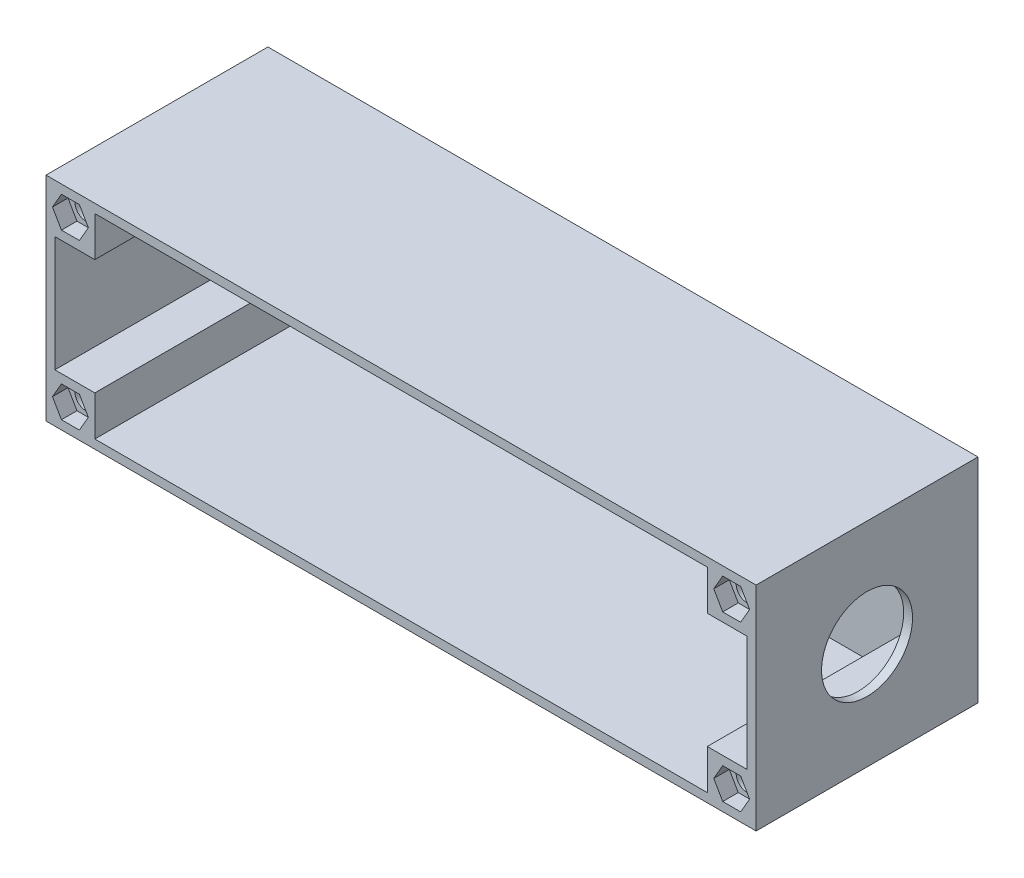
ISO-10303-21;
HEADER;
FILE_DESCRIPTION(('STEP AP214'),'2;1');
FILE_NAME('part.step','',(''),(''),'','','');
FILE_SCHEMA(('AUTOMOTIVE_DESIGN { 1 0 10303 214 1 1 1 1 }'));
ENDSEC;
DATA;
#1=APPLICATION_CONTEXT('core data for automotive mechanical design processes');
#2=APPLICATION_PROTOCOL_DEFINITION('international standard','automotive_design',2000,#1);
#3=PRODUCT_CONTEXT('',#1,'mechanical');
#4=PRODUCT('Part','Part','',(#3));
#5=PRODUCT_RELATED_PRODUCT_CATEGORY('part','',(#4));
#6=PRODUCT_DEFINITION_FORMATION('','',#4);
#7=PRODUCT_DEFINITION_CONTEXT('part definition',#1,'design');
#8=PRODUCT_DEFINITION('design','',#6,#7);
#9=PRODUCT_DEFINITION_SHAPE('','',#8);
#10=(LENGTH_UNIT() NAMED_UNIT(*) SI_UNIT(.MILLI.,.METRE.));
#11=(NAMED_UNIT(*) PLANE_ANGLE_UNIT() SI_UNIT($,.RADIAN.));
#12=(NAMED_UNIT(*) SI_UNIT($,.STERADIAN.) SOLID_ANGLE_UNIT());
#13=UNCERTAINTY_MEASURE_WITH_UNIT(LENGTH_MEASURE(1.E-05),#10,'distance_accuracy_value','');
#14=(GEOMETRIC_REPRESENTATION_CONTEXT(3) GLOBAL_UNCERTAINTY_ASSIGNED_CONTEXT((#13)) GLOBAL_UNIT_ASSIGNED_CONTEXT((#10,
#11,#12)) REPRESENTATION_CONTEXT('',''));
#15=CARTESIAN_POINT('',(0.,0.,0.));
#16=DIRECTION('',(0.,0.,1.));
#17=DIRECTION('',(1.,0.,0.));
#18=AXIS2_PLACEMENT_3D('',#15,#16,#17);
#19=CARTESIAN_POINT('',(0.,0.,50.));
#20=DIRECTION('',(1.,0.,0.));
#21=DIRECTION('',(0.,0.,-1.));
#22=AXIS2_PLACEMENT_3D('',#19,#20,#21);
#23=PLANE('',#22);
#24=DIRECTION('',(0.,-1.,0.));
#25=VECTOR('',#24,1.);
#26=CARTESIAN_POINT('',(0.,0.,0.));
#27=LINE('',#26,#25);
#28=CARTESIAN_POINT('',(0.,48.,0.));
#29=VERTEX_POINT('',#28);
#30=CARTESIAN_POINT('',(0.,0.,0.));
#31=VERTEX_POINT('',#30);
#32=EDGE_CURVE('E816',#29,#31,#27,.T.);
#33=ORIENTED_EDGE('',*,*,#32,.T.);
#34=DIRECTION('',(0.,0.,-1.));
#35=VECTOR('',#34,1.);
#36=CARTESIAN_POINT('',(0.,0.,50.));
#37=LINE('',#36,#35);
#38=CARTESIAN_POINT('',(0.,0.,50.));
#39=VERTEX_POINT('',#38);
#40=EDGE_CURVE('E887',#39,#31,#37,.T.);
#41=ORIENTED_EDGE('',*,*,#40,.F.);
#42=DIRECTION('',(0.,-1.,0.));
#43=VECTOR('',#42,1.);
#44=CARTESIAN_POINT('',(0.,0.,50.));
#45=LINE('',#44,#43);
#46=CARTESIAN_POINT('',(0.,48.,50.));
#47=VERTEX_POINT('',#46);
#48=EDGE_CURVE('E850',#47,#39,#45,.T.);
#49=ORIENTED_EDGE('',*,*,#48,.F.);
#50=DIRECTION('',(0.,0.,-1.));
#51=VECTOR('',#50,1.);
#52=CARTESIAN_POINT('',(0.,48.,50.));
#53=LINE('',#52,#51);
#54=EDGE_CURVE('E864',#47,#29,#53,.T.);
#55=ORIENTED_EDGE('',*,*,#54,.T.);
#56=EDGE_LOOP('',(#33,#41,#49,#55));
#57=FACE_BOUND('',#56,.T.);
#58=ADVANCED_FACE('F43',(#57),#23,.F.);
#59=CARTESIAN_POINT('',(0.,0.,50.));
#60=DIRECTION('',(0.,1.,0.));
#61=DIRECTION('',(0.,0.,1.));
#62=AXIS2_PLACEMENT_3D('',#59,#60,#61);
#63=PLANE('',#62);
#64=DIRECTION('',(1.,0.,0.));
#65=VECTOR('',#64,1.);
#66=CARTESIAN_POINT('',(0.,0.,0.));
#67=LINE('',#66,#65);
#68=CARTESIAN_POINT('',(160.,0.,0.));
#69=VERTEX_POINT('',#68);
#70=EDGE_CURVE('E868',#31,#69,#67,.T.);
#71=ORIENTED_EDGE('',*,*,#70,.T.);
#72=DIRECTION('',(0.,0.,-1.));
#73=VECTOR('',#72,1.);
#74=CARTESIAN_POINT('',(160.,0.,50.));
#75=LINE('',#74,#73);
#76=CARTESIAN_POINT('',(160.,0.,50.));
#77=VERTEX_POINT('',#76);
#78=EDGE_CURVE('E883',#77,#69,#75,.T.);
#79=ORIENTED_EDGE('',*,*,#78,.F.);
#80=DIRECTION('',(1.,0.,0.));
#81=VECTOR('',#80,1.);
#82=CARTESIAN_POINT('',(0.,0.,50.));
#83=LINE('',#82,#81);
#84=EDGE_CURVE('E854',#39,#77,#83,.T.);
#85=ORIENTED_EDGE('',*,*,#84,.F.);
#86=ORIENTED_EDGE('',*,*,#40,.T.);
#87=EDGE_LOOP('',(#71,#79,#85,#86));
#88=FACE_BOUND('',#87,.T.);
#89=ADVANCED_FACE('F951',(#88),#63,.F.);
#90=CARTESIAN_POINT('',(160.,0.,50.));
#91=DIRECTION('',(-1.,0.,0.));
#92=DIRECTION('',(0.,0.,1.));
#93=AXIS2_PLACEMENT_3D('',#90,#91,#92);
#94=PLANE('',#93);
#95=CARTESIAN_POINT('',(160.,24.,25.));
#96=DIRECTION('',(1.,0.,0.));
#97=DIRECTION('',(0.,0.,-1.));
#98=AXIS2_PLACEMENT_3D('',#95,#96,#97);
#99=CIRCLE('',#98,10.25);
#100=CARTESIAN_POINT('',(160.,24.,14.75));
#101=VERTEX_POINT('',#100);
#102=EDGE_CURVE('E701',#101,#101,#99,.T.);
#103=ORIENTED_EDGE('',*,*,#102,.F.);
#104=EDGE_LOOP('',(#103));
#105=FACE_BOUND('',#104,.T.);
#106=DIRECTION('',(0.,1.,0.));
#107=VECTOR('',#106,1.);
#108=CARTESIAN_POINT('',(160.,0.,0.));
#109=LINE('',#108,#107);
#110=CARTESIAN_POINT('',(160.,48.,0.));
#111=VERTEX_POINT('',#110);
#112=EDGE_CURVE('E871',#69,#111,#109,.T.);
#113=ORIENTED_EDGE('',*,*,#112,.T.);
#114=DIRECTION('',(0.,0.,-1.));
#115=VECTOR('',#114,1.);
#116=CARTESIAN_POINT('',(160.,48.,50.));
#117=LINE('',#116,#115);
#118=CARTESIAN_POINT('',(160.,48.,50.));
#119=VERTEX_POINT('',#118);
#120=EDGE_CURVE('E879',#119,#111,#117,.T.);
#121=ORIENTED_EDGE('',*,*,#120,.F.);
#122=DIRECTION('',(0.,1.,0.));
#123=VECTOR('',#122,1.);
#124=CARTESIAN_POINT('',(160.,0.,50.));
#125=LINE('',#124,#123);
#126=EDGE_CURVE('E858',#77,#119,#125,.T.);
#127=ORIENTED_EDGE('',*,*,#126,.F.);
#128=ORIENTED_EDGE('',*,*,#78,.T.);
#129=EDGE_LOOP('',(#113,#121,#127,#128));
#130=FACE_BOUND('',#129,.T.);
#131=ADVANCED_FACE('F956',(#105,#130),#94,.F.);
#132=CARTESIAN_POINT('',(0.,48.,50.));
#133=DIRECTION('',(0.,-1.,0.));
#134=DIRECTION('',(0.,0.,-1.));
#135=AXIS2_PLACEMENT_3D('',#132,#133,#134);
#136=PLANE('',#135);
#137=DIRECTION('',(-1.,0.,0.));
#138=VECTOR('',#137,1.);
#139=CARTESIAN_POINT('',(0.,48.,0.));
#140=LINE('',#139,#138);
#141=EDGE_CURVE('E855',#111,#29,#140,.T.);
#142=ORIENTED_EDGE('',*,*,#141,.T.);
#143=ORIENTED_EDGE('',*,*,#54,.F.);
#144=DIRECTION('',(-1.,0.,0.));
#145=VECTOR('',#144,1.);
#146=CARTESIAN_POINT('',(0.,48.,50.));
#147=LINE('',#146,#145);
#148=EDGE_CURVE('E861',#119,#47,#147,.T.);
#149=ORIENTED_EDGE('',*,*,#148,.F.);
#150=ORIENTED_EDGE('',*,*,#120,.T.);
#151=EDGE_LOOP('',(#142,#143,#149,#150));
#152=FACE_BOUND('',#151,.T.);
#153=ADVANCED_FACE('F972',(#152),#136,.F.);
#154=CARTESIAN_POINT('',(0.,0.,50.));
#155=DIRECTION('',(0.,0.,-1.));
#156=DIRECTION('',(-1.,0.,0.));
#157=AXIS2_PLACEMENT_3D('',#154,#155,#156);
#158=PLANE('',#157);
#159=DIRECTION('',(0.500000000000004,0.866025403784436,0.));
#160=VECTOR('',#159,1.);
#161=CARTESIAN_POINT('',(158.541451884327,42.5,50.));
#162=LINE('',#161,#160);
#163=CARTESIAN_POINT('',(156.520725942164,39.,50.));
#164=VERTEX_POINT('',#163);
#165=CARTESIAN_POINT('',(158.541451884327,42.5,50.));
#166=VERTEX_POINT('',#165);
#167=EDGE_CURVE('E537',#164,#166,#162,.T.);
#168=ORIENTED_EDGE('',*,*,#167,.F.);
#169=DIRECTION('',(1.,0.,0.));
#170=VECTOR('',#169,1.);
#171=CARTESIAN_POINT('',(156.520725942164,39.,50.));
#172=LINE('',#171,#170);
#173=CARTESIAN_POINT('',(152.479274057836,39.,50.));
#174=VERTEX_POINT('',#173);
#175=EDGE_CURVE('E541',#174,#164,#172,.T.);
#176=ORIENTED_EDGE('',*,*,#175,.F.);
#177=DIRECTION('',(0.499999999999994,-0.866025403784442,0.));
#178=VECTOR('',#177,1.);
#179=CARTESIAN_POINT('',(152.479274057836,39.,50.));
#180=LINE('',#179,#178);
#181=CARTESIAN_POINT('',(150.458548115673,42.5,50.));
#182=VERTEX_POINT('',#181);
#183=EDGE_CURVE('E520',#182,#174,#180,.T.);
#184=ORIENTED_EDGE('',*,*,#183,.F.);
#185=DIRECTION('',(-0.499999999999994,-0.866025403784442,0.));
#186=VECTOR('',#185,1.);
#187=CARTESIAN_POINT('',(150.458548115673,42.5,50.));
#188=LINE('',#187,#186);
#189=CARTESIAN_POINT('',(152.479274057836,46.,50.));
#190=VERTEX_POINT('',#189);
#191=EDGE_CURVE('E524',#190,#182,#188,.T.);
#192=ORIENTED_EDGE('',*,*,#191,.F.);
#193=DIRECTION('',(-1.,0.,0.));
#194=VECTOR('',#193,1.);
#195=CARTESIAN_POINT('',(152.479274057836,46.,50.));
#196=LINE('',#195,#194);
#197=CARTESIAN_POINT('',(156.520725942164,46.,50.));
#198=VERTEX_POINT('',#197);
#199=EDGE_CURVE('E529',#198,#190,#196,.T.);
#200=ORIENTED_EDGE('',*,*,#199,.F.);
#201=DIRECTION('',(-0.499999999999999,0.866025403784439,0.));
#202=VECTOR('',#201,1.);
#203=CARTESIAN_POINT('',(156.520725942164,46.,50.));
#204=LINE('',#203,#202);
#205=EDGE_CURVE('E533',#166,#198,#204,.T.);
#206=ORIENTED_EDGE('',*,*,#205,.F.);
#207=EDGE_LOOP('',(#168,#176,#184,#192,#200,#206));
#208=FACE_BOUND('',#207,.T.);
#209=DIRECTION('',(-0.5,-0.866025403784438,0.));
#210=VECTOR('',#209,1.);
#211=CARTESIAN_POINT('',(1.45854811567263,5.5,50.));
#212=LINE('',#211,#210);
#213=CARTESIAN_POINT('',(3.47927405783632,8.99999999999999,50.));
#214=VERTEX_POINT('',#213);
#215=CARTESIAN_POINT('',(1.45854811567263,5.5,50.));
#216=VERTEX_POINT('',#215);
#217=EDGE_CURVE('E603',#214,#216,#212,.T.);
#218=ORIENTED_EDGE('',*,*,#217,.F.);
#219=DIRECTION('',(-1.,0.,0.));
#220=VECTOR('',#219,1.);
#221=CARTESIAN_POINT('',(3.47927405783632,8.99999999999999,50.));
#222=LINE('',#221,#220);
#223=CARTESIAN_POINT('',(7.5207259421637,8.99999999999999,50.));
#224=VERTEX_POINT('',#223);
#225=EDGE_CURVE('E519',#224,#214,#222,.T.);
#226=ORIENTED_EDGE('',*,*,#225,.F.);
#227=DIRECTION('',(-0.5,0.866025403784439,0.));
#228=VECTOR('',#227,1.);
#229=CARTESIAN_POINT('',(7.5207259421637,8.99999999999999,50.));
#230=LINE('',#229,#228);
#231=CARTESIAN_POINT('',(9.54145188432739,5.5,50.));
#232=VERTEX_POINT('',#231);
#233=EDGE_CURVE('E586',#232,#224,#230,.T.);
#234=ORIENTED_EDGE('',*,*,#233,.F.);
#235=DIRECTION('',(0.5,0.866025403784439,0.));
#236=VECTOR('',#235,1.);
#237=CARTESIAN_POINT('',(9.54145188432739,5.5,50.));
#238=LINE('',#237,#236);
#239=CARTESIAN_POINT('',(7.5207259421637,2.,50.));
#240=VERTEX_POINT('',#239);
#241=EDGE_CURVE('E590',#240,#232,#238,.T.);
#242=ORIENTED_EDGE('',*,*,#241,.F.);
#243=DIRECTION('',(1.,0.,0.));
#244=VECTOR('',#243,1.);
#245=CARTESIAN_POINT('',(7.5207259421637,2.,50.));
#246=LINE('',#245,#244);
#247=CARTESIAN_POINT('',(3.47927405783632,2.,50.));
#248=VERTEX_POINT('',#247);
#249=EDGE_CURVE('E595',#248,#240,#246,.T.);
#250=ORIENTED_EDGE('',*,*,#249,.F.);
#251=DIRECTION('',(0.5,-0.866025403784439,0.));
#252=VECTOR('',#251,1.);
#253=CARTESIAN_POINT('',(3.47927405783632,2.,50.));
#254=LINE('',#253,#252);
#255=EDGE_CURVE('E599',#216,#248,#254,.T.);
#256=ORIENTED_EDGE('',*,*,#255,.F.);
#257=EDGE_LOOP('',(#218,#226,#234,#242,#250,#256));
#258=FACE_BOUND('',#257,.T.);
#259=DIRECTION('',(-1.,0.,0.));
#260=VECTOR('',#259,1.);
#261=CARTESIAN_POINT('',(156.520725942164,8.99999999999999,50.));
#262=LINE('',#261,#260);
#263=CARTESIAN_POINT('',(156.520725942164,8.99999999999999,50.));
#264=VERTEX_POINT('',#263);
#265=CARTESIAN_POINT('',(152.479274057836,8.99999999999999,50.));
#266=VERTEX_POINT('',#265);
#267=EDGE_CURVE('E469',#264,#266,#262,.T.);
#268=ORIENTED_EDGE('',*,*,#267,.F.);
#269=DIRECTION('',(-0.500000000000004,0.866025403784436,0.));
#270=VECTOR('',#269,1.);
#271=CARTESIAN_POINT('',(158.541451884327,5.5,50.));
#272=LINE('',#271,#270);
#273=CARTESIAN_POINT('',(158.541451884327,5.5,50.));
#274=VERTEX_POINT('',#273);
#275=EDGE_CURVE('E473',#274,#264,#272,.T.);
#276=ORIENTED_EDGE('',*,*,#275,.F.);
#277=DIRECTION('',(0.499999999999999,0.866025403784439,0.));
#278=VECTOR('',#277,1.);
#279=CARTESIAN_POINT('',(156.520725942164,2.,50.));
#280=LINE('',#279,#278);
#281=CARTESIAN_POINT('',(156.520725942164,2.,50.));
#282=VERTEX_POINT('',#281);
#283=EDGE_CURVE('E452',#282,#274,#280,.T.);
#284=ORIENTED_EDGE('',*,*,#283,.F.);
#285=DIRECTION('',(1.,0.,0.));
#286=VECTOR('',#285,1.);
#287=CARTESIAN_POINT('',(152.479274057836,2.,50.));
#288=LINE('',#287,#286);
#289=CARTESIAN_POINT('',(152.479274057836,2.,50.));
#290=VERTEX_POINT('',#289);
#291=EDGE_CURVE('E456',#290,#282,#288,.T.);
#292=ORIENTED_EDGE('',*,*,#291,.F.);
#293=DIRECTION('',(0.499999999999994,-0.866025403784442,0.));
#294=VECTOR('',#293,1.);
#295=CARTESIAN_POINT('',(150.458548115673,5.5,50.));
#296=LINE('',#295,#294);
#297=CARTESIAN_POINT('',(150.458548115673,5.5,50.));
#298=VERTEX_POINT('',#297);
#299=EDGE_CURVE('E461',#298,#290,#296,.T.);
#300=ORIENTED_EDGE('',*,*,#299,.F.);
#301=DIRECTION('',(-0.499999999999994,-0.866025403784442,0.));
#302=VECTOR('',#301,1.);
#303=CARTESIAN_POINT('',(152.479274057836,8.99999999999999,50.));
#304=LINE('',#303,#302);
#305=EDGE_CURVE('E465',#266,#298,#304,.T.);
#306=ORIENTED_EDGE('',*,*,#305,.F.);
#307=EDGE_LOOP('',(#268,#276,#284,#292,#300,#306));
#308=FACE_BOUND('',#307,.T.);
#309=DIRECTION('',(-0.5,0.866025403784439,0.));
#310=VECTOR('',#309,1.);
#311=CARTESIAN_POINT('',(9.54145188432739,42.5,50.));
#312=LINE('',#311,#310);
#313=CARTESIAN_POINT('',(9.54145188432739,42.5,50.));
#314=VERTEX_POINT('',#313);
#315=CARTESIAN_POINT('',(7.5207259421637,46.,50.));
#316=VERTEX_POINT('',#315);
#317=EDGE_CURVE('E659',#314,#316,#312,.T.);
#318=ORIENTED_EDGE('',*,*,#317,.F.);
#319=DIRECTION('',(0.5,0.866025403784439,0.));
#320=VECTOR('',#319,1.);
#321=CARTESIAN_POINT('',(7.5207259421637,39.,50.));
#322=LINE('',#321,#320);
#323=CARTESIAN_POINT('',(7.5207259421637,39.,50.));
#324=VERTEX_POINT('',#323);
#325=EDGE_CURVE('E544',#324,#314,#322,.T.);
#326=ORIENTED_EDGE('',*,*,#325,.F.);
#327=DIRECTION('',(1.,0.,0.));
#328=VECTOR('',#327,1.);
#329=CARTESIAN_POINT('',(3.47927405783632,39.,50.));
#330=LINE('',#329,#328);
#331=CARTESIAN_POINT('',(3.47927405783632,39.,50.));
#332=VERTEX_POINT('',#331);
#333=EDGE_CURVE('E636',#332,#324,#330,.T.);
#334=ORIENTED_EDGE('',*,*,#333,.F.);
#335=DIRECTION('',(0.5,-0.866025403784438,0.));
#336=VECTOR('',#335,1.);
#337=CARTESIAN_POINT('',(1.45854811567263,42.5,50.));
#338=LINE('',#337,#336);
#339=CARTESIAN_POINT('',(1.45854811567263,42.5,50.));
#340=VERTEX_POINT('',#339);
#341=EDGE_CURVE('E671',#340,#332,#338,.T.);
#342=ORIENTED_EDGE('',*,*,#341,.F.);
#343=DIRECTION('',(-0.5,-0.866025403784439,0.));
#344=VECTOR('',#343,1.);
#345=CARTESIAN_POINT('',(3.47927405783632,46.,50.));
#346=LINE('',#345,#344);
#347=CARTESIAN_POINT('',(3.47927405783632,46.,50.));
#348=VERTEX_POINT('',#347);
#349=EDGE_CURVE('E667',#348,#340,#346,.T.);
#350=ORIENTED_EDGE('',*,*,#349,.F.);
#351=DIRECTION('',(-1.,0.,0.));
#352=VECTOR('',#351,1.);
#353=CARTESIAN_POINT('',(7.5207259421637,46.,50.));
#354=LINE('',#353,#352);
#355=EDGE_CURVE('E663',#316,#348,#354,.T.);
#356=ORIENTED_EDGE('',*,*,#355,.F.);
#357=EDGE_LOOP('',(#318,#326,#334,#342,#350,#356));
#358=FACE_BOUND('',#357,.T.);
#359=DIRECTION('',(-1.,0.,0.));
#360=VECTOR('',#359,1.);
#361=CARTESIAN_POINT('',(11.,37.,50.));
#362=LINE('',#361,#360);
#363=CARTESIAN_POINT('',(11.,37.,50.));
#364=VERTEX_POINT('',#363);
#365=CARTESIAN_POINT('',(2.,37.,50.));
#366=VERTEX_POINT('',#365);
#367=EDGE_CURVE('E770',#364,#366,#362,.T.);
#368=ORIENTED_EDGE('',*,*,#367,.F.);
#369=DIRECTION('',(0.,-1.,0.));
#370=VECTOR('',#369,1.);
#371=CARTESIAN_POINT('',(11.,46.,50.));
#372=LINE('',#371,#370);
#373=CARTESIAN_POINT('',(11.,46.,50.));
#374=VERTEX_POINT('',#373);
#375=EDGE_CURVE('E767',#374,#364,#372,.T.);
#376=ORIENTED_EDGE('',*,*,#375,.F.);
#377=DIRECTION('',(-1.,0.,0.));
#378=VECTOR('',#377,1.);
#379=CARTESIAN_POINT('',(11.,46.,50.));
#380=LINE('',#379,#378);
#381=CARTESIAN_POINT('',(149.,46.,50.));
#382=VERTEX_POINT('',#381);
#383=EDGE_CURVE('E722',#382,#374,#380,.T.);
#384=ORIENTED_EDGE('',*,*,#383,.F.);
#385=DIRECTION('',(0.,1.,0.));
#386=VECTOR('',#385,1.);
#387=CARTESIAN_POINT('',(149.,46.,50.));
#388=LINE('',#387,#386);
#389=CARTESIAN_POINT('',(149.,37.,50.));
#390=VERTEX_POINT('',#389);
#391=EDGE_CURVE('E806',#390,#382,#388,.T.);
#392=ORIENTED_EDGE('',*,*,#391,.F.);
#393=DIRECTION('',(-1.,0.,0.));
#394=VECTOR('',#393,1.);
#395=CARTESIAN_POINT('',(149.,37.,50.));
#396=LINE('',#395,#394);
#397=CARTESIAN_POINT('',(158.,37.,50.));
#398=VERTEX_POINT('',#397);
#399=EDGE_CURVE('E802',#398,#390,#396,.T.);
#400=ORIENTED_EDGE('',*,*,#399,.F.);
#401=DIRECTION('',(0.,1.,0.));
#402=VECTOR('',#401,1.);
#403=CARTESIAN_POINT('',(158.,37.,50.));
#404=LINE('',#403,#402);
#405=CARTESIAN_POINT('',(158.,11.,50.));
#406=VERTEX_POINT('',#405);
#407=EDGE_CURVE('E798',#406,#398,#404,.T.);
#408=ORIENTED_EDGE('',*,*,#407,.F.);
#409=DIRECTION('',(1.,0.,0.));
#410=VECTOR('',#409,1.);
#411=CARTESIAN_POINT('',(149.,11.,50.));
#412=LINE('',#411,#410);
#413=CARTESIAN_POINT('',(149.,11.,50.));
#414=VERTEX_POINT('',#413);
#415=EDGE_CURVE('E794',#414,#406,#412,.T.);
#416=ORIENTED_EDGE('',*,*,#415,.F.);
#417=DIRECTION('',(0.,1.,0.));
#418=VECTOR('',#417,1.);
#419=CARTESIAN_POINT('',(149.,2.,50.));
#420=LINE('',#419,#418);
#421=CARTESIAN_POINT('',(149.,2.,50.));
#422=VERTEX_POINT('',#421);
#423=EDGE_CURVE('E790',#422,#414,#420,.T.);
#424=ORIENTED_EDGE('',*,*,#423,.F.);
#425=DIRECTION('',(1.,0.,0.));
#426=VECTOR('',#425,1.);
#427=CARTESIAN_POINT('',(11.,2.,50.));
#428=LINE('',#427,#426);
#429=CARTESIAN_POINT('',(11.,2.,50.));
#430=VERTEX_POINT('',#429);
#431=EDGE_CURVE('E786',#430,#422,#428,.T.);
#432=ORIENTED_EDGE('',*,*,#431,.F.);
#433=DIRECTION('',(0.,-1.,0.));
#434=VECTOR('',#433,1.);
#435=CARTESIAN_POINT('',(11.,11.,50.));
#436=LINE('',#435,#434);
#437=CARTESIAN_POINT('',(11.,11.,50.));
#438=VERTEX_POINT('',#437);
#439=EDGE_CURVE('E782',#438,#430,#436,.T.);
#440=ORIENTED_EDGE('',*,*,#439,.F.);
#441=DIRECTION('',(1.,0.,0.));
#442=VECTOR('',#441,1.);
#443=CARTESIAN_POINT('',(2.,11.,50.));
#444=LINE('',#443,#442);
#445=CARTESIAN_POINT('',(2.,11.,50.));
#446=VERTEX_POINT('',#445);
#447=EDGE_CURVE('E778',#446,#438,#444,.T.);
#448=ORIENTED_EDGE('',*,*,#447,.F.);
#449=DIRECTION('',(0.,-1.,0.));
#450=VECTOR('',#449,1.);
#451=CARTESIAN_POINT('',(2.,37.,50.));
#452=LINE('',#451,#450);
#453=EDGE_CURVE('E774',#366,#446,#452,.T.);
#454=ORIENTED_EDGE('',*,*,#453,.F.);
#455=EDGE_LOOP('',(#368,#376,#384,#392,#400,#408,#416,#424,#432,#440,#448,#454));
#456=FACE_BOUND('',#455,.T.);
#457=ORIENTED_EDGE('',*,*,#48,.T.);
#458=ORIENTED_EDGE('',*,*,#84,.T.);
#459=ORIENTED_EDGE('',*,*,#126,.T.);
#460=ORIENTED_EDGE('',*,*,#148,.T.);
#461=EDGE_LOOP('',(#457,#458,#459,#460));
#462=FACE_BOUND('',#461,.T.);
#463=ADVANCED_FACE('F968',(#208,#258,#308,#358,#456,#462),#158,.F.);
#464=CARTESIAN_POINT('',(0.,0.,0.));
#465=DIRECTION('',(0.,0.,-1.));
#466=DIRECTION('',(-1.,0.,0.));
#467=AXIS2_PLACEMENT_3D('',#464,#465,#466);
#468=PLANE('',#467);
#469=CARTESIAN_POINT('',(144.5,24.,0.));
#470=DIRECTION('',(0.,0.,-1.));
#471=DIRECTION('',(-1.,0.,0.));
#472=AXIS2_PLACEMENT_3D('',#469,#470,#471);
#473=CIRCLE('',#472,2.5);
#474=CARTESIAN_POINT('',(144.5,26.5,0.));
#475=VERTEX_POINT('',#474);
#476=CARTESIAN_POINT('',(144.5,21.5,0.));
#477=VERTEX_POINT('',#476);
#478=EDGE_CURVE('E58',#475,#477,#473,.T.);
#479=ORIENTED_EDGE('',*,*,#478,.F.);
#480=DIRECTION('',(1.,0.,0.));
#481=VECTOR('',#480,1.);
#482=CARTESIAN_POINT('',(144.5,26.5,0.));
#483=LINE('',#482,#481);
#484=CARTESIAN_POINT('',(141.5,26.5,0.));
#485=VERTEX_POINT('',#484);
#486=EDGE_CURVE('E374',#485,#475,#483,.T.);
#487=ORIENTED_EDGE('',*,*,#486,.F.);
#488=CARTESIAN_POINT('',(141.5,24.,0.));
#489=DIRECTION('',(0.,0.,-1.));
#490=DIRECTION('',(-1.,0.,0.));
#491=AXIS2_PLACEMENT_3D('',#488,#489,#490);
#492=CIRCLE('',#491,2.5);
#493=CARTESIAN_POINT('',(141.5,21.5,0.));
#494=VERTEX_POINT('',#493);
#495=EDGE_CURVE('E355',#494,#485,#492,.T.);
#496=ORIENTED_EDGE('',*,*,#495,.F.);
#497=DIRECTION('',(-1.,0.,0.));
#498=VECTOR('',#497,1.);
#499=CARTESIAN_POINT('',(144.5,21.5,0.));
#500=LINE('',#499,#498);
#501=EDGE_CURVE('E366',#477,#494,#500,.T.);
#502=ORIENTED_EDGE('',*,*,#501,.F.);
#503=EDGE_LOOP('',(#479,#487,#496,#502));
#504=FACE_BOUND('',#503,.T.);
#505=CARTESIAN_POINT('',(15.5,24.,0.));
#506=DIRECTION('',(0.,0.,-1.));
#507=DIRECTION('',(1.,0.,0.));
#508=AXIS2_PLACEMENT_3D('',#505,#506,#507);
#509=CIRCLE('',#508,2.5);
#510=CARTESIAN_POINT('',(15.5,21.5,0.));
#511=VERTEX_POINT('',#510);
#512=CARTESIAN_POINT('',(15.5,26.5,0.));
#513=VERTEX_POINT('',#512);
#514=EDGE_CURVE('E66',#511,#513,#509,.T.);
#515=ORIENTED_EDGE('',*,*,#514,.F.);
#516=DIRECTION('',(-1.,0.,0.));
#517=VECTOR('',#516,1.);
#518=CARTESIAN_POINT('',(15.5,21.5,0.));
#519=LINE('',#518,#517);
#520=CARTESIAN_POINT('',(18.5,21.5,0.));
#521=VERTEX_POINT('',#520);
#522=EDGE_CURVE('E392',#521,#511,#519,.T.);
#523=ORIENTED_EDGE('',*,*,#522,.F.);
#524=CARTESIAN_POINT('',(18.5,24.,0.));
#525=DIRECTION('',(0.,0.,-1.));
#526=DIRECTION('',(1.,0.,0.));
#527=AXIS2_PLACEMENT_3D('',#524,#525,#526);
#528=CIRCLE('',#527,2.5);
#529=CARTESIAN_POINT('',(18.5,26.5,0.));
#530=VERTEX_POINT('',#529);
#531=EDGE_CURVE('E405',#530,#521,#528,.T.);
#532=ORIENTED_EDGE('',*,*,#531,.F.);
#533=DIRECTION('',(1.,0.,0.));
#534=VECTOR('',#533,1.);
#535=CARTESIAN_POINT('',(15.5,26.5,0.));
#536=LINE('',#535,#534);
#537=EDGE_CURVE('E409',#513,#530,#536,.T.);
#538=ORIENTED_EDGE('',*,*,#537,.F.);
#539=EDGE_LOOP('',(#515,#523,#532,#538));
#540=FACE_BOUND('',#539,.T.);
#541=CARTESIAN_POINT('',(120.,24.,0.));
#542=DIRECTION('',(0.,0.,-1.));
#543=DIRECTION('',(-1.,0.,0.));
#544=AXIS2_PLACEMENT_3D('',#541,#542,#543);
#545=CIRCLE('',#544,13.);
#546=CARTESIAN_POINT('',(107.,24.,0.));
#547=VERTEX_POINT('',#546);
#548=EDGE_CURVE('E702',#547,#547,#545,.T.);
#549=ORIENTED_EDGE('',*,*,#548,.F.);
#550=EDGE_LOOP('',(#549));
#551=FACE_BOUND('',#550,.T.);
#552=CARTESIAN_POINT('',(40.,24.,0.));
#553=DIRECTION('',(0.,0.,-1.));
#554=DIRECTION('',(-1.,0.,0.));
#555=AXIS2_PLACEMENT_3D('',#552,#553,#554);
#556=CIRCLE('',#555,13.);
#557=CARTESIAN_POINT('',(27.,24.,0.));
#558=VERTEX_POINT('',#557);
#559=EDGE_CURVE('E706',#558,#558,#556,.T.);
#560=ORIENTED_EDGE('',*,*,#559,.F.);
#561=EDGE_LOOP('',(#560));
#562=FACE_BOUND('',#561,.T.);
#563=ORIENTED_EDGE('',*,*,#32,.F.);
#564=ORIENTED_EDGE('',*,*,#141,.F.);
#565=ORIENTED_EDGE('',*,*,#112,.F.);
#566=ORIENTED_EDGE('',*,*,#70,.F.);
#567=EDGE_LOOP('',(#563,#564,#565,#566));
#568=FACE_BOUND('',#567,.T.);
#569=ADVANCED_FACE('F371',(#504,#540,#551,#562,#568),#468,.T.);
#570=CARTESIAN_POINT('',(11.,46.,6.00000000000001));
#571=DIRECTION('',(-1.,0.,0.));
#572=DIRECTION('',(0.,0.,1.));
#573=AXIS2_PLACEMENT_3D('',#570,#571,#572);
#574=PLANE('',#573);
#575=ORIENTED_EDGE('',*,*,#375,.T.);
#576=DIRECTION('',(0.,0.,1.));
#577=VECTOR('',#576,1.);
#578=CARTESIAN_POINT('',(11.,37.,6.00000000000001));
#579=LINE('',#578,#577);
#580=CARTESIAN_POINT('',(11.,37.,6.00000000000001));
#581=VERTEX_POINT('',#580);
#582=EDGE_CURVE('E766',#581,#364,#579,.T.);
#583=ORIENTED_EDGE('',*,*,#582,.F.);
#584=DIRECTION('',(0.,-1.,0.));
#585=VECTOR('',#584,1.);
#586=CARTESIAN_POINT('',(11.,46.,6.00000000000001));
#587=LINE('',#586,#585);
#588=CARTESIAN_POINT('',(11.,46.,6.00000000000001));
#589=VERTEX_POINT('',#588);
#590=EDGE_CURVE('E717',#589,#581,#587,.T.);
#591=ORIENTED_EDGE('',*,*,#590,.F.);
#592=DIRECTION('',(0.,0.,1.));
#593=VECTOR('',#592,1.);
#594=CARTESIAN_POINT('',(11.,46.,6.00000000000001));
#595=LINE('',#594,#593);
#596=EDGE_CURVE('E813',#589,#374,#595,.T.);
#597=ORIENTED_EDGE('',*,*,#596,.T.);
#598=EDGE_LOOP('',(#575,#583,#591,#597));
#599=FACE_BOUND('',#598,.T.);
#600=ADVANCED_FACE('F985',(#599),#574,.F.);
#601=CARTESIAN_POINT('',(11.,46.,6.00000000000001));
#602=DIRECTION('',(0.,1.,0.));
#603=DIRECTION('',(0.,0.,1.));
#604=AXIS2_PLACEMENT_3D('',#601,#602,#603);
#605=PLANE('',#604);
#606=ORIENTED_EDGE('',*,*,#383,.T.);
#607=ORIENTED_EDGE('',*,*,#596,.F.);
#608=DIRECTION('',(-1.,0.,0.));
#609=VECTOR('',#608,1.);
#610=CARTESIAN_POINT('',(11.,46.,6.00000000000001));
#611=LINE('',#610,#609);
#612=CARTESIAN_POINT('',(149.,46.,6.00000000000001));
#613=VERTEX_POINT('',#612);
#614=EDGE_CURVE('E762',#613,#589,#611,.T.);
#615=ORIENTED_EDGE('',*,*,#614,.F.);
#616=DIRECTION('',(0.,0.,1.));
#617=VECTOR('',#616,1.);
#618=CARTESIAN_POINT('',(149.,46.,6.00000000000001));
#619=LINE('',#618,#617);
#620=EDGE_CURVE('E817',#613,#382,#619,.T.);
#621=ORIENTED_EDGE('',*,*,#620,.T.);
#622=EDGE_LOOP('',(#606,#607,#615,#621));
#623=FACE_BOUND('',#622,.T.);
#624=ADVANCED_FACE('F991',(#623),#605,.F.);
#625=CARTESIAN_POINT('',(149.,46.,6.00000000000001));
#626=DIRECTION('',(1.,0.,0.));
#627=DIRECTION('',(0.,0.,-1.));
#628=AXIS2_PLACEMENT_3D('',#625,#626,#627);
#629=PLANE('',#628);
#630=ORIENTED_EDGE('',*,*,#391,.T.);
#631=ORIENTED_EDGE('',*,*,#620,.F.);
#632=DIRECTION('',(0.,1.,0.));
#633=VECTOR('',#632,1.);
#634=CARTESIAN_POINT('',(149.,46.,6.00000000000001));
#635=LINE('',#634,#633);
#636=CARTESIAN_POINT('',(149.,37.,6.00000000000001));
#637=VERTEX_POINT('',#636);
#638=EDGE_CURVE('E758',#637,#613,#635,.T.);
#639=ORIENTED_EDGE('',*,*,#638,.F.);
#640=DIRECTION('',(0.,0.,1.));
#641=VECTOR('',#640,1.);
#642=CARTESIAN_POINT('',(149.,37.,6.00000000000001));
#643=LINE('',#642,#641);
#644=EDGE_CURVE('E820',#637,#390,#643,.T.);
#645=ORIENTED_EDGE('',*,*,#644,.T.);
#646=EDGE_LOOP('',(#630,#631,#639,#645));
#647=FACE_BOUND('',#646,.T.);
#648=ADVANCED_FACE('F1028',(#647),#629,.F.);
#649=CARTESIAN_POINT('',(149.,37.,6.00000000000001));
#650=DIRECTION('',(0.,1.,0.));
#651=DIRECTION('',(0.,0.,1.));
#652=AXIS2_PLACEMENT_3D('',#649,#650,#651);
#653=PLANE('',#652);
#654=ORIENTED_EDGE('',*,*,#399,.T.);
#655=ORIENTED_EDGE('',*,*,#644,.F.);
#656=DIRECTION('',(-1.,0.,0.));
#657=VECTOR('',#656,1.);
#658=CARTESIAN_POINT('',(149.,37.,6.00000000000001));
#659=LINE('',#658,#657);
#660=CARTESIAN_POINT('',(158.,37.,6.00000000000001));
#661=VERTEX_POINT('',#660);
#662=EDGE_CURVE('E754',#661,#637,#659,.T.);
#663=ORIENTED_EDGE('',*,*,#662,.F.);
#664=DIRECTION('',(0.,0.,1.));
#665=VECTOR('',#664,1.);
#666=CARTESIAN_POINT('',(158.,37.,6.00000000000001));
#667=LINE('',#666,#665);
#668=EDGE_CURVE('E823',#661,#398,#667,.T.);
#669=ORIENTED_EDGE('',*,*,#668,.T.);
#670=EDGE_LOOP('',(#654,#655,#663,#669));
#671=FACE_BOUND('',#670,.T.);
#672=ADVANCED_FACE('F1024',(#671),#653,.F.);
#673=CARTESIAN_POINT('',(158.,37.,6.00000000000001));
#674=DIRECTION('',(1.,0.,0.));
#675=DIRECTION('',(0.,0.,-1.));
#676=AXIS2_PLACEMENT_3D('',#673,#674,#675);
#677=PLANE('',#676);
#678=CARTESIAN_POINT('',(158.,24.,25.));
#679=DIRECTION('',(1.,0.,0.));
#680=DIRECTION('',(0.,0.,-1.));
#681=AXIS2_PLACEMENT_3D('',#678,#679,#680);
#682=CIRCLE('',#681,10.25);
#683=CARTESIAN_POINT('',(158.,24.,14.75));
#684=VERTEX_POINT('',#683);
#685=EDGE_CURVE('E716',#684,#684,#682,.T.);
#686=ORIENTED_EDGE('',*,*,#685,.T.);
#687=EDGE_LOOP('',(#686));
#688=FACE_BOUND('',#687,.T.);
#689=ORIENTED_EDGE('',*,*,#407,.T.);
#690=ORIENTED_EDGE('',*,*,#668,.F.);
#691=DIRECTION('',(0.,1.,0.));
#692=VECTOR('',#691,1.);
#693=CARTESIAN_POINT('',(158.,37.,6.00000000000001));
#694=LINE('',#693,#692);
#695=CARTESIAN_POINT('',(158.,11.,6.00000000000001));
#696=VERTEX_POINT('',#695);
#697=EDGE_CURVE('E750',#696,#661,#694,.T.);
#698=ORIENTED_EDGE('',*,*,#697,.F.);
#699=DIRECTION('',(0.,0.,1.));
#700=VECTOR('',#699,1.);
#701=CARTESIAN_POINT('',(158.,11.,6.00000000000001));
#702=LINE('',#701,#700);
#703=EDGE_CURVE('E826',#696,#406,#702,.T.);
#704=ORIENTED_EDGE('',*,*,#703,.T.);
#705=EDGE_LOOP('',(#689,#690,#698,#704));
#706=FACE_BOUND('',#705,.T.);
#707=ADVANCED_FACE('F1020',(#688,#706),#677,.F.);
#708=CARTESIAN_POINT('',(149.,11.,6.00000000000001));
#709=DIRECTION('',(0.,-1.,0.));
#710=DIRECTION('',(0.,0.,-1.));
#711=AXIS2_PLACEMENT_3D('',#708,#709,#710);
#712=PLANE('',#711);
#713=ORIENTED_EDGE('',*,*,#415,.T.);
#714=ORIENTED_EDGE('',*,*,#703,.F.);
#715=DIRECTION('',(1.,0.,0.));
#716=VECTOR('',#715,1.);
#717=CARTESIAN_POINT('',(149.,11.,6.00000000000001));
#718=LINE('',#717,#716);
#719=CARTESIAN_POINT('',(149.,11.,6.00000000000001));
#720=VERTEX_POINT('',#719);
#721=EDGE_CURVE('E746',#720,#696,#718,.T.);
#722=ORIENTED_EDGE('',*,*,#721,.F.);
#723=DIRECTION('',(0.,0.,1.));
#724=VECTOR('',#723,1.);
#725=CARTESIAN_POINT('',(149.,11.,6.00000000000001));
#726=LINE('',#725,#724);
#727=EDGE_CURVE('E829',#720,#414,#726,.T.);
#728=ORIENTED_EDGE('',*,*,#727,.T.);
#729=EDGE_LOOP('',(#713,#714,#722,#728));
#730=FACE_BOUND('',#729,.T.);
#731=ADVANCED_FACE('F1016',(#730),#712,.F.);
#732=CARTESIAN_POINT('',(149.,2.,6.00000000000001));
#733=DIRECTION('',(1.,0.,0.));
#734=DIRECTION('',(0.,0.,-1.));
#735=AXIS2_PLACEMENT_3D('',#732,#733,#734);
#736=PLANE('',#735);
#737=ORIENTED_EDGE('',*,*,#423,.T.);
#738=ORIENTED_EDGE('',*,*,#727,.F.);
#739=DIRECTION('',(0.,1.,0.));
#740=VECTOR('',#739,1.);
#741=CARTESIAN_POINT('',(149.,2.,6.00000000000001));
#742=LINE('',#741,#740);
#743=CARTESIAN_POINT('',(149.,2.,6.00000000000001));
#744=VERTEX_POINT('',#743);
#745=EDGE_CURVE('E742',#744,#720,#742,.T.);
#746=ORIENTED_EDGE('',*,*,#745,.F.);
#747=DIRECTION('',(0.,0.,1.));
#748=VECTOR('',#747,1.);
#749=CARTESIAN_POINT('',(149.,2.,6.00000000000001));
#750=LINE('',#749,#748);
#751=EDGE_CURVE('E832',#744,#422,#750,.T.);
#752=ORIENTED_EDGE('',*,*,#751,.T.);
#753=EDGE_LOOP('',(#737,#738,#746,#752));
#754=FACE_BOUND('',#753,.T.);
#755=ADVANCED_FACE('F1012',(#754),#736,.F.);
#756=CARTESIAN_POINT('',(11.,2.,6.00000000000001));
#757=DIRECTION('',(0.,-1.,0.));
#758=DIRECTION('',(1.,0.,0.));
#759=AXIS2_PLACEMENT_3D('',#756,#757,#758);
#760=PLANE('',#759);
#761=ORIENTED_EDGE('',*,*,#431,.T.);
#762=ORIENTED_EDGE('',*,*,#751,.F.);
#763=DIRECTION('',(1.,0.,0.));
#764=VECTOR('',#763,1.);
#765=CARTESIAN_POINT('',(11.,2.,6.00000000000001));
#766=LINE('',#765,#764);
#767=CARTESIAN_POINT('',(11.,2.,6.00000000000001));
#768=VERTEX_POINT('',#767);
#769=EDGE_CURVE('E738',#768,#744,#766,.T.);
#770=ORIENTED_EDGE('',*,*,#769,.F.);
#771=DIRECTION('',(0.,0.,1.));
#772=VECTOR('',#771,1.);
#773=CARTESIAN_POINT('',(11.,2.,6.00000000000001));
#774=LINE('',#773,#772);
#775=EDGE_CURVE('E835',#768,#430,#774,.T.);
#776=ORIENTED_EDGE('',*,*,#775,.T.);
#777=EDGE_LOOP('',(#761,#762,#770,#776));
#778=FACE_BOUND('',#777,.T.);
#779=ADVANCED_FACE('F1008',(#778),#760,.F.);
#780=CARTESIAN_POINT('',(11.,11.,6.00000000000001));
#781=DIRECTION('',(-1.,0.,0.));
#782=DIRECTION('',(0.,0.,1.));
#783=AXIS2_PLACEMENT_3D('',#780,#781,#782);
#784=PLANE('',#783);
#785=ORIENTED_EDGE('',*,*,#439,.T.);
#786=ORIENTED_EDGE('',*,*,#775,.F.);
#787=DIRECTION('',(0.,-1.,0.));
#788=VECTOR('',#787,1.);
#789=CARTESIAN_POINT('',(11.,11.,6.00000000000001));
#790=LINE('',#789,#788);
#791=CARTESIAN_POINT('',(11.,11.,6.00000000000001));
#792=VERTEX_POINT('',#791);
#793=EDGE_CURVE('E734',#792,#768,#790,.T.);
#794=ORIENTED_EDGE('',*,*,#793,.F.);
#795=DIRECTION('',(0.,0.,1.));
#796=VECTOR('',#795,1.);
#797=CARTESIAN_POINT('',(11.,11.,6.00000000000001));
#798=LINE('',#797,#796);
#799=EDGE_CURVE('E838',#792,#438,#798,.T.);
#800=ORIENTED_EDGE('',*,*,#799,.T.);
#801=EDGE_LOOP('',(#785,#786,#794,#800));
#802=FACE_BOUND('',#801,.T.);
#803=ADVANCED_FACE('F1004',(#802),#784,.F.);
#804=CARTESIAN_POINT('',(2.,11.,6.00000000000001));
#805=DIRECTION('',(0.,-1.,0.));
#806=DIRECTION('',(0.,0.,-1.));
#807=AXIS2_PLACEMENT_3D('',#804,#805,#806);
#808=PLANE('',#807);
#809=ORIENTED_EDGE('',*,*,#447,.T.);
#810=ORIENTED_EDGE('',*,*,#799,.F.);
#811=DIRECTION('',(1.,0.,0.));
#812=VECTOR('',#811,1.);
#813=CARTESIAN_POINT('',(2.,11.,6.00000000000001));
#814=LINE('',#813,#812);
#815=CARTESIAN_POINT('',(2.,11.,6.00000000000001));
#816=VERTEX_POINT('',#815);
#817=EDGE_CURVE('E730',#816,#792,#814,.T.);
#818=ORIENTED_EDGE('',*,*,#817,.F.);
#819=DIRECTION('',(0.,0.,1.));
#820=VECTOR('',#819,1.);
#821=CARTESIAN_POINT('',(2.,11.,6.00000000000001));
#822=LINE('',#821,#820);
#823=EDGE_CURVE('E841',#816,#446,#822,.T.);
#824=ORIENTED_EDGE('',*,*,#823,.T.);
#825=EDGE_LOOP('',(#809,#810,#818,#824));
#826=FACE_BOUND('',#825,.T.);
#827=ADVANCED_FACE('F1000',(#826),#808,.F.);
#828=CARTESIAN_POINT('',(2.,37.,6.00000000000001));
#829=DIRECTION('',(-1.,0.,0.));
#830=DIRECTION('',(0.,-1.,0.));
#831=AXIS2_PLACEMENT_3D('',#828,#829,#830);
#832=PLANE('',#831);
#833=ORIENTED_EDGE('',*,*,#453,.T.);
#834=ORIENTED_EDGE('',*,*,#823,.F.);
#835=DIRECTION('',(0.,-1.,0.));
#836=VECTOR('',#835,1.);
#837=CARTESIAN_POINT('',(2.,37.,6.00000000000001));
#838=LINE('',#837,#836);
#839=CARTESIAN_POINT('',(2.,37.,6.00000000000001));
#840=VERTEX_POINT('',#839);
#841=EDGE_CURVE('E726',#840,#816,#838,.T.);
#842=ORIENTED_EDGE('',*,*,#841,.F.);
#843=DIRECTION('',(0.,0.,1.));
#844=VECTOR('',#843,1.);
#845=CARTESIAN_POINT('',(2.,37.,6.00000000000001));
#846=LINE('',#845,#844);
#847=EDGE_CURVE('E844',#840,#366,#846,.T.);
#848=ORIENTED_EDGE('',*,*,#847,.T.);
#849=EDGE_LOOP('',(#833,#834,#842,#848));
#850=FACE_BOUND('',#849,.T.);
#851=ADVANCED_FACE('F996',(#850),#832,.F.);
#852=CARTESIAN_POINT('',(11.,37.,6.00000000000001));
#853=DIRECTION('',(0.,1.,0.));
#854=DIRECTION('',(0.,0.,1.));
#855=AXIS2_PLACEMENT_3D('',#852,#853,#854);
#856=PLANE('',#855);
#857=ORIENTED_EDGE('',*,*,#367,.T.);
#858=ORIENTED_EDGE('',*,*,#847,.F.);
#859=DIRECTION('',(-1.,0.,0.));
#860=VECTOR('',#859,1.);
#861=CARTESIAN_POINT('',(11.,37.,6.00000000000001));
#862=LINE('',#861,#860);
#863=EDGE_CURVE('E721',#581,#840,#862,.T.);
#864=ORIENTED_EDGE('',*,*,#863,.F.);
#865=ORIENTED_EDGE('',*,*,#582,.T.);
#866=EDGE_LOOP('',(#857,#858,#864,#865));
#867=FACE_BOUND('',#866,.T.);
#868=ADVANCED_FACE('F993',(#867),#856,.F.);
#869=CARTESIAN_POINT('',(0.,0.,6.00000000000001));
#870=DIRECTION('',(0.,0.,-1.));
#871=DIRECTION('',(-1.,0.,0.));
#872=AXIS2_PLACEMENT_3D('',#869,#870,#871);
#873=PLANE('',#872);
#874=DIRECTION('',(1.,0.,0.));
#875=VECTOR('',#874,1.);
#876=CARTESIAN_POINT('',(0.,26.5,6.00000000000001));
#877=LINE('',#876,#875);
#878=CARTESIAN_POINT('',(141.5,26.5,6.00000000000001));
#879=VERTEX_POINT('',#878);
#880=CARTESIAN_POINT('',(144.5,26.5,6.00000000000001));
#881=VERTEX_POINT('',#880);
#882=EDGE_CURVE('E51',#879,#881,#877,.T.);
#883=ORIENTED_EDGE('',*,*,#882,.T.);
#884=CARTESIAN_POINT('',(144.5,24.,6.00000000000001));
#885=DIRECTION('',(0.,0.,-1.));
#886=DIRECTION('',(-1.,0.,0.));
#887=AXIS2_PLACEMENT_3D('',#884,#885,#886);
#888=CIRCLE('',#887,2.5);
#889=CARTESIAN_POINT('',(144.5,21.5,6.00000000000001));
#890=VERTEX_POINT('',#889);
#891=EDGE_CURVE('E11',#881,#890,#888,.T.);
#892=ORIENTED_EDGE('',*,*,#891,.T.);
#893=DIRECTION('',(-1.,0.,0.));
#894=VECTOR('',#893,1.);
#895=CARTESIAN_POINT('',(0.,21.5,6.00000000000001));
#896=LINE('',#895,#894);
#897=CARTESIAN_POINT('',(141.5,21.5,6.00000000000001));
#898=VERTEX_POINT('',#897);
#899=EDGE_CURVE('E924',#890,#898,#896,.T.);
#900=ORIENTED_EDGE('',*,*,#899,.T.);
#901=CARTESIAN_POINT('',(141.5,24.,6.00000000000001));
#902=DIRECTION('',(0.,0.,-1.));
#903=DIRECTION('',(-1.,0.,0.));
#904=AXIS2_PLACEMENT_3D('',#901,#902,#903);
#905=CIRCLE('',#904,2.5);
#906=EDGE_CURVE('E358',#898,#879,#905,.T.);
#907=ORIENTED_EDGE('',*,*,#906,.T.);
#908=EDGE_LOOP('',(#883,#892,#900,#907));
#909=FACE_BOUND('',#908,.T.);
#910=DIRECTION('',(-1.,0.,0.));
#911=VECTOR('',#910,1.);
#912=CARTESIAN_POINT('',(0.,21.5,6.00000000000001));
#913=LINE('',#912,#911);
#914=CARTESIAN_POINT('',(18.5,21.5,6.00000000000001));
#915=VERTEX_POINT('',#914);
#916=CARTESIAN_POINT('',(15.5,21.5,6.00000000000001));
#917=VERTEX_POINT('',#916);
#918=EDGE_CURVE('E916',#915,#917,#913,.T.);
#919=ORIENTED_EDGE('',*,*,#918,.T.);
#920=CARTESIAN_POINT('',(15.5,24.,6.00000000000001));
#921=DIRECTION('',(0.,0.,-1.));
#922=DIRECTION('',(-1.,0.,0.));
#923=AXIS2_PLACEMENT_3D('',#920,#921,#922);
#924=CIRCLE('',#923,2.5);
#925=CARTESIAN_POINT('',(15.5,26.5,6.00000000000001));
#926=VERTEX_POINT('',#925);
#927=EDGE_CURVE('E920',#917,#926,#924,.T.);
#928=ORIENTED_EDGE('',*,*,#927,.T.);
#929=DIRECTION('',(1.,0.,0.));
#930=VECTOR('',#929,1.);
#931=CARTESIAN_POINT('',(0.,26.5,6.00000000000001));
#932=LINE('',#931,#930);
#933=CARTESIAN_POINT('',(18.5,26.5,6.00000000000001));
#934=VERTEX_POINT('',#933);
#935=EDGE_CURVE('E891',#926,#934,#932,.T.);
#936=ORIENTED_EDGE('',*,*,#935,.T.);
#937=CARTESIAN_POINT('',(18.5,24.,6.00000000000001));
#938=DIRECTION('',(0.,0.,-1.));
#939=DIRECTION('',(-1.,0.,0.));
#940=AXIS2_PLACEMENT_3D('',#937,#938,#939);
#941=CIRCLE('',#940,2.5);
#942=EDGE_CURVE('E912',#934,#915,#941,.T.);
#943=ORIENTED_EDGE('',*,*,#942,.T.);
#944=EDGE_LOOP('',(#919,#928,#936,#943));
#945=FACE_BOUND('',#944,.T.);
#946=ORIENTED_EDGE('',*,*,#590,.T.);
#947=ORIENTED_EDGE('',*,*,#863,.T.);
#948=ORIENTED_EDGE('',*,*,#841,.T.);
#949=ORIENTED_EDGE('',*,*,#817,.T.);
#950=ORIENTED_EDGE('',*,*,#793,.T.);
#951=ORIENTED_EDGE('',*,*,#769,.T.);
#952=ORIENTED_EDGE('',*,*,#745,.T.);
#953=ORIENTED_EDGE('',*,*,#721,.T.);
#954=ORIENTED_EDGE('',*,*,#697,.T.);
#955=ORIENTED_EDGE('',*,*,#662,.T.);
#956=ORIENTED_EDGE('',*,*,#638,.T.);
#957=ORIENTED_EDGE('',*,*,#614,.T.);
#958=EDGE_LOOP('',(#946,#947,#948,#949,#950,#951,#952,#953,#954,#955,#956,#957));
#959=FACE_BOUND('',#958,.T.);
#960=ADVANCED_FACE('F931',(#909,#945,#959),#873,.F.);
#961=CARTESIAN_POINT('',(157.,24.,25.));
#962=DIRECTION('',(1.,0.,0.));
#963=DIRECTION('',(0.,0.,-1.));
#964=AXIS2_PLACEMENT_3D('',#961,#962,#963);
#965=CYLINDRICAL_SURFACE('',#964,10.25);
#966=ORIENTED_EDGE('',*,*,#102,.T.);
#967=EDGE_LOOP('',(#966));
#968=FACE_BOUND('',#967,.T.);
#969=ORIENTED_EDGE('',*,*,#685,.F.);
#970=EDGE_LOOP('',(#969));
#971=FACE_BOUND('',#970,.T.);
#972=ADVANCED_FACE('F1038',(#968,#971),#965,.F.);
#973=CARTESIAN_POINT('',(40.,24.,4.));
#974=DIRECTION('',(0.,0.,-1.));
#975=DIRECTION('',(-1.,0.,0.));
#976=AXIS2_PLACEMENT_3D('',#973,#974,#975);
#977=CYLINDRICAL_SURFACE('',#976,13.);
#978=CARTESIAN_POINT('',(40.,24.,4.));
#979=DIRECTION('',(0.,0.,-1.));
#980=DIRECTION('',(-1.,0.,0.));
#981=AXIS2_PLACEMENT_3D('',#978,#979,#980);
#982=CIRCLE('',#981,13.);
#983=CARTESIAN_POINT('',(27.,24.,4.));
#984=VERTEX_POINT('',#983);
#985=EDGE_CURVE('E681',#984,#984,#982,.T.);
#986=ORIENTED_EDGE('',*,*,#985,.F.);
#987=EDGE_LOOP('',(#986));
#988=FACE_BOUND('',#987,.T.);
#989=ORIENTED_EDGE('',*,*,#559,.T.);
#990=EDGE_LOOP('',(#989));
#991=FACE_BOUND('',#990,.T.);
#992=ADVANCED_FACE('F1041',(#988,#991),#977,.F.);
#993=CARTESIAN_POINT('',(40.,24.,4.));
#994=DIRECTION('',(0.,0.,-1.));
#995=DIRECTION('',(-1.,0.,0.));
#996=AXIS2_PLACEMENT_3D('',#993,#994,#995);
#997=PLANE('',#996);
#998=ORIENTED_EDGE('',*,*,#985,.T.);
#999=EDGE_LOOP('',(#998));
#1000=FACE_BOUND('',#999,.T.);
#1001=ADVANCED_FACE('F1043',(#1000),#997,.T.);
#1002=CARTESIAN_POINT('',(120.,24.,4.));
#1003=DIRECTION('',(0.,0.,-1.));
#1004=DIRECTION('',(-1.,0.,0.));
#1005=AXIS2_PLACEMENT_3D('',#1002,#1003,#1004);
#1006=CYLINDRICAL_SURFACE('',#1005,13.);
#1007=CARTESIAN_POINT('',(120.,24.,4.));
#1008=DIRECTION('',(0.,0.,-1.));
#1009=DIRECTION('',(-1.,0.,0.));
#1010=AXIS2_PLACEMENT_3D('',#1007,#1008,#1009);
#1011=CIRCLE('',#1010,13.);
#1012=CARTESIAN_POINT('',(107.,24.,4.));
#1013=VERTEX_POINT('',#1012);
#1014=EDGE_CURVE('E697',#1013,#1013,#1011,.T.);
#1015=ORIENTED_EDGE('',*,*,#1014,.F.);
#1016=EDGE_LOOP('',(#1015));
#1017=FACE_BOUND('',#1016,.T.);
#1018=ORIENTED_EDGE('',*,*,#548,.T.);
#1019=EDGE_LOOP('',(#1018));
#1020=FACE_BOUND('',#1019,.T.);
#1021=ADVANCED_FACE('F1046',(#1017,#1020),#1006,.F.);
#1022=CARTESIAN_POINT('',(120.,24.,4.));
#1023=DIRECTION('',(0.,0.,-1.));
#1024=DIRECTION('',(-1.,0.,0.));
#1025=AXIS2_PLACEMENT_3D('',#1022,#1023,#1024);
#1026=PLANE('',#1025);
#1027=ORIENTED_EDGE('',*,*,#1014,.T.);
#1028=EDGE_LOOP('',(#1027));
#1029=FACE_BOUND('',#1028,.T.);
#1030=ADVANCED_FACE('F1053',(#1029),#1026,.T.);
#1031=CARTESIAN_POINT('',(7.5207259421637,39.,46.5));
#1032=DIRECTION('',(0.866025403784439,-0.5,0.));
#1033=DIRECTION('',(0.5,0.866025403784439,0.));
#1034=AXIS2_PLACEMENT_3D('',#1031,#1032,#1033);
#1035=PLANE('',#1034);
#1036=ORIENTED_EDGE('',*,*,#325,.T.);
#1037=DIRECTION('',(0.,0.,1.));
#1038=VECTOR('',#1037,1.);
#1039=CARTESIAN_POINT('',(9.54145188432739,42.5,46.5));
#1040=LINE('',#1039,#1038);
#1041=CARTESIAN_POINT('',(9.54145188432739,42.5,46.5));
#1042=VERTEX_POINT('',#1041);
#1043=EDGE_CURVE('E656',#1042,#314,#1040,.T.);
#1044=ORIENTED_EDGE('',*,*,#1043,.F.);
#1045=DIRECTION('',(0.5,0.866025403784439,0.));
#1046=VECTOR('',#1045,1.);
#1047=CARTESIAN_POINT('',(7.5207259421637,39.,46.5));
#1048=LINE('',#1047,#1046);
#1049=CARTESIAN_POINT('',(7.5207259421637,39.,46.5));
#1050=VERTEX_POINT('',#1049);
#1051=EDGE_CURVE('E631',#1050,#1042,#1048,.T.);
#1052=ORIENTED_EDGE('',*,*,#1051,.F.);
#1053=DIRECTION('',(0.,0.,1.));
#1054=VECTOR('',#1053,1.);
#1055=CARTESIAN_POINT('',(7.5207259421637,39.,46.5));
#1056=LINE('',#1055,#1054);
#1057=EDGE_CURVE('E678',#1050,#324,#1056,.T.);
#1058=ORIENTED_EDGE('',*,*,#1057,.T.);
#1059=EDGE_LOOP('',(#1036,#1044,#1052,#1058));
#1060=FACE_BOUND('',#1059,.T.);
#1061=ADVANCED_FACE('F1057',(#1060),#1035,.F.);
#1062=CARTESIAN_POINT('',(3.47927405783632,39.,46.5));
#1063=DIRECTION('',(0.,-1.,0.));
#1064=DIRECTION('',(0.,0.,-1.));
#1065=AXIS2_PLACEMENT_3D('',#1062,#1063,#1064);
#1066=PLANE('',#1065);
#1067=ORIENTED_EDGE('',*,*,#333,.T.);
#1068=ORIENTED_EDGE('',*,*,#1057,.F.);
#1069=DIRECTION('',(1.,0.,0.));
#1070=VECTOR('',#1069,1.);
#1071=CARTESIAN_POINT('',(3.47927405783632,39.,46.5));
#1072=LINE('',#1071,#1070);
#1073=CARTESIAN_POINT('',(3.47927405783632,39.,46.5));
#1074=VERTEX_POINT('',#1073);
#1075=EDGE_CURVE('E652',#1074,#1050,#1072,.T.);
#1076=ORIENTED_EDGE('',*,*,#1075,.F.);
#1077=DIRECTION('',(0.,0.,1.));
#1078=VECTOR('',#1077,1.);
#1079=CARTESIAN_POINT('',(3.47927405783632,39.,46.5));
#1080=LINE('',#1079,#1078);
#1081=EDGE_CURVE('E682',#1074,#332,#1080,.T.);
#1082=ORIENTED_EDGE('',*,*,#1081,.T.);
#1083=EDGE_LOOP('',(#1067,#1068,#1076,#1082));
#1084=FACE_BOUND('',#1083,.T.);
#1085=ADVANCED_FACE('F1061',(#1084),#1066,.F.);
#1086=CARTESIAN_POINT('',(1.45854811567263,42.5,46.5));
#1087=DIRECTION('',(-0.866025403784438,-0.5,0.));
#1088=DIRECTION('',(0.5,-0.866025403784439,0.));
#1089=AXIS2_PLACEMENT_3D('',#1086,#1087,#1088);
#1090=PLANE('',#1089);
#1091=ORIENTED_EDGE('',*,*,#341,.T.);
#1092=ORIENTED_EDGE('',*,*,#1081,.F.);
#1093=DIRECTION('',(0.5,-0.866025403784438,0.));
#1094=VECTOR('',#1093,1.);
#1095=CARTESIAN_POINT('',(1.45854811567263,42.5,46.5));
#1096=LINE('',#1095,#1094);
#1097=CARTESIAN_POINT('',(1.45854811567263,42.5,46.5));
#1098=VERTEX_POINT('',#1097);
#1099=EDGE_CURVE('E648',#1098,#1074,#1096,.T.);
#1100=ORIENTED_EDGE('',*,*,#1099,.F.);
#1101=DIRECTION('',(0.,0.,1.));
#1102=VECTOR('',#1101,1.);
#1103=CARTESIAN_POINT('',(1.45854811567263,42.5,46.5));
#1104=LINE('',#1103,#1102);
#1105=EDGE_CURVE('E685',#1098,#340,#1104,.T.);
#1106=ORIENTED_EDGE('',*,*,#1105,.T.);
#1107=EDGE_LOOP('',(#1091,#1092,#1100,#1106));
#1108=FACE_BOUND('',#1107,.T.);
#1109=ADVANCED_FACE('F1075',(#1108),#1090,.F.);
#1110=CARTESIAN_POINT('',(3.47927405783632,46.,46.5));
#1111=DIRECTION('',(-0.866025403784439,0.5,0.));
#1112=DIRECTION('',(-0.5,-0.866025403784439,0.));
#1113=AXIS2_PLACEMENT_3D('',#1110,#1111,#1112);
#1114=PLANE('',#1113);
#1115=ORIENTED_EDGE('',*,*,#349,.T.);
#1116=ORIENTED_EDGE('',*,*,#1105,.F.);
#1117=DIRECTION('',(-0.5,-0.866025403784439,0.));
#1118=VECTOR('',#1117,1.);
#1119=CARTESIAN_POINT('',(3.47927405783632,46.,46.5));
#1120=LINE('',#1119,#1118);
#1121=CARTESIAN_POINT('',(3.47927405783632,46.,46.5));
#1122=VERTEX_POINT('',#1121);
#1123=EDGE_CURVE('E644',#1122,#1098,#1120,.T.);
#1124=ORIENTED_EDGE('',*,*,#1123,.F.);
#1125=DIRECTION('',(0.,0.,1.));
#1126=VECTOR('',#1125,1.);
#1127=CARTESIAN_POINT('',(3.47927405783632,46.,46.5));
#1128=LINE('',#1127,#1126);
#1129=EDGE_CURVE('E688',#1122,#348,#1128,.T.);
#1130=ORIENTED_EDGE('',*,*,#1129,.T.);
#1131=EDGE_LOOP('',(#1115,#1116,#1124,#1130));
#1132=FACE_BOUND('',#1131,.T.);
#1133=ADVANCED_FACE('F1071',(#1132),#1114,.F.);
#1134=CARTESIAN_POINT('',(7.5207259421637,46.,46.5));
#1135=DIRECTION('',(0.,1.,0.));
#1136=DIRECTION('',(0.,0.,1.));
#1137=AXIS2_PLACEMENT_3D('',#1134,#1135,#1136);
#1138=PLANE('',#1137);
#1139=ORIENTED_EDGE('',*,*,#355,.T.);
#1140=ORIENTED_EDGE('',*,*,#1129,.F.);
#1141=DIRECTION('',(-1.,0.,0.));
#1142=VECTOR('',#1141,1.);
#1143=CARTESIAN_POINT('',(7.5207259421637,46.,46.5));
#1144=LINE('',#1143,#1142);
#1145=CARTESIAN_POINT('',(7.5207259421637,46.,46.5));
#1146=VERTEX_POINT('',#1145);
#1147=EDGE_CURVE('E640',#1146,#1122,#1144,.T.);
#1148=ORIENTED_EDGE('',*,*,#1147,.F.);
#1149=DIRECTION('',(0.,0.,1.));
#1150=VECTOR('',#1149,1.);
#1151=CARTESIAN_POINT('',(7.5207259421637,46.,46.5));
#1152=LINE('',#1151,#1150);
#1153=EDGE_CURVE('E691',#1146,#316,#1152,.T.);
#1154=ORIENTED_EDGE('',*,*,#1153,.T.);
#1155=EDGE_LOOP('',(#1139,#1140,#1148,#1154));
#1156=FACE_BOUND('',#1155,.T.);
#1157=ADVANCED_FACE('F1067',(#1156),#1138,.F.);
#1158=CARTESIAN_POINT('',(9.54145188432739,42.5,46.5));
#1159=DIRECTION('',(0.866025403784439,0.5,0.));
#1160=DIRECTION('',(-0.5,0.866025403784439,0.));
#1161=AXIS2_PLACEMENT_3D('',#1158,#1159,#1160);
#1162=PLANE('',#1161);
#1163=ORIENTED_EDGE('',*,*,#317,.T.);
#1164=ORIENTED_EDGE('',*,*,#1153,.F.);
#1165=DIRECTION('',(-0.5,0.866025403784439,0.));
#1166=VECTOR('',#1165,1.);
#1167=CARTESIAN_POINT('',(9.54145188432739,42.5,46.5));
#1168=LINE('',#1167,#1166);
#1169=EDGE_CURVE('E635',#1042,#1146,#1168,.T.);
#1170=ORIENTED_EDGE('',*,*,#1169,.F.);
#1171=ORIENTED_EDGE('',*,*,#1043,.T.);
#1172=EDGE_LOOP('',(#1163,#1164,#1170,#1171));
#1173=FACE_BOUND('',#1172,.T.);
#1174=ADVANCED_FACE('F1063',(#1173),#1162,.F.);
#1175=CARTESIAN_POINT('',(0.,0.,46.5));
#1176=DIRECTION('',(0.,0.,1.));
#1177=DIRECTION('',(1.,0.,0.));
#1178=AXIS2_PLACEMENT_3D('',#1175,#1176,#1177);
#1179=PLANE('',#1178);
#1180=CARTESIAN_POINT('',(5.50000000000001,42.5,46.5));
#1181=DIRECTION('',(0.,0.,1.));
#1182=DIRECTION('',(1.,0.,0.));
#1183=AXIS2_PLACEMENT_3D('',#1180,#1181,#1182);
#1184=CIRCLE('',#1183,2.5);
#1185=CARTESIAN_POINT('',(8.00000000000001,42.5,46.5));
#1186=VERTEX_POINT('',#1185);
#1187=EDGE_CURVE('E451',#1186,#1186,#1184,.T.);
#1188=ORIENTED_EDGE('',*,*,#1187,.F.);
#1189=EDGE_LOOP('',(#1188));
#1190=FACE_BOUND('',#1189,.T.);
#1191=ORIENTED_EDGE('',*,*,#1051,.T.);
#1192=ORIENTED_EDGE('',*,*,#1169,.T.);
#1193=ORIENTED_EDGE('',*,*,#1147,.T.);
#1194=ORIENTED_EDGE('',*,*,#1123,.T.);
#1195=ORIENTED_EDGE('',*,*,#1099,.T.);
#1196=ORIENTED_EDGE('',*,*,#1075,.T.);
#1197=EDGE_LOOP('',(#1191,#1192,#1193,#1194,#1195,#1196));
#1198=FACE_BOUND('',#1197,.T.);
#1199=ADVANCED_FACE('F1066',(#1190,#1198),#1179,.T.);
#1200=CARTESIAN_POINT('',(158.541451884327,5.5,46.5));
#1201=DIRECTION('',(0.866025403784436,0.500000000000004,0.));
#1202=DIRECTION('',(-0.500000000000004,0.866025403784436,0.));
#1203=AXIS2_PLACEMENT_3D('',#1200,#1201,#1202);
#1204=PLANE('',#1203);
#1205=ORIENTED_EDGE('',*,*,#275,.T.);
#1206=DIRECTION('',(0.,0.,1.));
#1207=VECTOR('',#1206,1.);
#1208=CARTESIAN_POINT('',(156.520725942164,8.99999999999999,46.5));
#1209=LINE('',#1208,#1207);
#1210=CARTESIAN_POINT('',(156.520725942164,8.99999999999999,46.5));
#1211=VERTEX_POINT('',#1210);
#1212=EDGE_CURVE('E431',#1211,#264,#1209,.T.);
#1213=ORIENTED_EDGE('',*,*,#1212,.F.);
#1214=DIRECTION('',(-0.500000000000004,0.866025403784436,0.));
#1215=VECTOR('',#1214,1.);
#1216=CARTESIAN_POINT('',(158.541451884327,5.5,46.5));
#1217=LINE('',#1216,#1215);
#1218=CARTESIAN_POINT('',(158.541451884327,5.5,46.5));
#1219=VERTEX_POINT('',#1218);
#1220=EDGE_CURVE('E457',#1219,#1211,#1217,.T.);
#1221=ORIENTED_EDGE('',*,*,#1220,.F.);
#1222=DIRECTION('',(0.,0.,1.));
#1223=VECTOR('',#1222,1.);
#1224=CARTESIAN_POINT('',(158.541451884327,5.5,46.5));
#1225=LINE('',#1224,#1223);
#1226=EDGE_CURVE('E448',#1219,#274,#1225,.T.);
#1227=ORIENTED_EDGE('',*,*,#1226,.T.);
#1228=EDGE_LOOP('',(#1205,#1213,#1221,#1227));
#1229=FACE_BOUND('',#1228,.T.);
#1230=ADVANCED_FACE('F1085',(#1229),#1204,.F.);
#1231=CARTESIAN_POINT('',(156.520725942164,2.,46.5));
#1232=DIRECTION('',(0.866025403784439,-0.499999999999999,0.));
#1233=DIRECTION('',(0.499999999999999,0.866025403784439,0.));
#1234=AXIS2_PLACEMENT_3D('',#1231,#1232,#1233);
#1235=PLANE('',#1234);
#1236=ORIENTED_EDGE('',*,*,#283,.T.);
#1237=ORIENTED_EDGE('',*,*,#1226,.F.);
#1238=DIRECTION('',(0.499999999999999,0.866025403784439,0.));
#1239=VECTOR('',#1238,1.);
#1240=CARTESIAN_POINT('',(156.520725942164,2.,46.5));
#1241=LINE('',#1240,#1239);
#1242=CARTESIAN_POINT('',(156.520725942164,2.,46.5));
#1243=VERTEX_POINT('',#1242);
#1244=EDGE_CURVE('E435',#1243,#1219,#1241,.T.);
#1245=ORIENTED_EDGE('',*,*,#1244,.F.);
#1246=DIRECTION('',(0.,0.,1.));
#1247=VECTOR('',#1246,1.);
#1248=CARTESIAN_POINT('',(156.520725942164,2.,46.5));
#1249=LINE('',#1248,#1247);
#1250=EDGE_CURVE('E445',#1243,#282,#1249,.T.);
#1251=ORIENTED_EDGE('',*,*,#1250,.T.);
#1252=EDGE_LOOP('',(#1236,#1237,#1245,#1251));
#1253=FACE_BOUND('',#1252,.T.);
#1254=ADVANCED_FACE('F1149',(#1253),#1235,.F.);
#1255=CARTESIAN_POINT('',(152.479274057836,2.,46.5));
#1256=DIRECTION('',(0.,-1.,0.));
#1257=DIRECTION('',(0.,0.,-1.));
#1258=AXIS2_PLACEMENT_3D('',#1255,#1256,#1257);
#1259=PLANE('',#1258);
#1260=ORIENTED_EDGE('',*,*,#291,.T.);
#1261=ORIENTED_EDGE('',*,*,#1250,.F.);
#1262=DIRECTION('',(1.,0.,0.));
#1263=VECTOR('',#1262,1.);
#1264=CARTESIAN_POINT('',(152.479274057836,2.,46.5));
#1265=LINE('',#1264,#1263);
#1266=CARTESIAN_POINT('',(152.479274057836,2.,46.5));
#1267=VERTEX_POINT('',#1266);
#1268=EDGE_CURVE('E480',#1267,#1243,#1265,.T.);
#1269=ORIENTED_EDGE('',*,*,#1268,.F.);
#1270=DIRECTION('',(0.,0.,1.));
#1271=VECTOR('',#1270,1.);
#1272=CARTESIAN_POINT('',(152.479274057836,2.,46.5));
#1273=LINE('',#1272,#1271);
#1274=EDGE_CURVE('E442',#1267,#290,#1273,.T.);
#1275=ORIENTED_EDGE('',*,*,#1274,.T.);
#1276=EDGE_LOOP('',(#1260,#1261,#1269,#1275));
#1277=FACE_BOUND('',#1276,.T.);
#1278=ADVANCED_FACE('F1152',(#1277),#1259,.F.);
#1279=CARTESIAN_POINT('',(150.458548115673,5.5,46.5));
#1280=DIRECTION('',(-0.866025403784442,-0.499999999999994,0.));
#1281=DIRECTION('',(0.499999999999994,-0.866025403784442,0.));
#1282=AXIS2_PLACEMENT_3D('',#1279,#1280,#1281);
#1283=PLANE('',#1282);
#1284=ORIENTED_EDGE('',*,*,#299,.T.);
#1285=ORIENTED_EDGE('',*,*,#1274,.F.);
#1286=DIRECTION('',(0.499999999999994,-0.866025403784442,0.));
#1287=VECTOR('',#1286,1.);
#1288=CARTESIAN_POINT('',(150.458548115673,5.5,46.5));
#1289=LINE('',#1288,#1287);
#1290=CARTESIAN_POINT('',(150.458548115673,5.5,46.5));
#1291=VERTEX_POINT('',#1290);
#1292=EDGE_CURVE('E484',#1291,#1267,#1289,.T.);
#1293=ORIENTED_EDGE('',*,*,#1292,.F.);
#1294=DIRECTION('',(0.,0.,1.));
#1295=VECTOR('',#1294,1.);
#1296=CARTESIAN_POINT('',(150.458548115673,5.5,46.5));
#1297=LINE('',#1296,#1295);
#1298=EDGE_CURVE('E439',#1291,#298,#1297,.T.);
#1299=ORIENTED_EDGE('',*,*,#1298,.T.);
#1300=EDGE_LOOP('',(#1284,#1285,#1293,#1299));
#1301=FACE_BOUND('',#1300,.T.);
#1302=ADVANCED_FACE('F1156',(#1301),#1283,.F.);
#1303=CARTESIAN_POINT('',(152.479274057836,8.99999999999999,46.5));
#1304=DIRECTION('',(-0.866025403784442,0.499999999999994,0.));
#1305=DIRECTION('',(-0.499999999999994,-0.866025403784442,0.));
#1306=AXIS2_PLACEMENT_3D('',#1303,#1304,#1305);
#1307=PLANE('',#1306);
#1308=ORIENTED_EDGE('',*,*,#305,.T.);
#1309=ORIENTED_EDGE('',*,*,#1298,.F.);
#1310=DIRECTION('',(-0.499999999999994,-0.866025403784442,0.));
#1311=VECTOR('',#1310,1.);
#1312=CARTESIAN_POINT('',(152.479274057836,8.99999999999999,46.5));
#1313=LINE('',#1312,#1311);
#1314=CARTESIAN_POINT('',(152.479274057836,8.99999999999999,46.5));
#1315=VERTEX_POINT('',#1314);
#1316=EDGE_CURVE('E488',#1315,#1291,#1313,.T.);
#1317=ORIENTED_EDGE('',*,*,#1316,.F.);
#1318=DIRECTION('',(0.,0.,1.));
#1319=VECTOR('',#1318,1.);
#1320=CARTESIAN_POINT('',(152.479274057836,8.99999999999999,46.5));
#1321=LINE('',#1320,#1319);
#1322=EDGE_CURVE('E436',#1315,#266,#1321,.T.);
#1323=ORIENTED_EDGE('',*,*,#1322,.T.);
#1324=EDGE_LOOP('',(#1308,#1309,#1317,#1323));
#1325=FACE_BOUND('',#1324,.T.);
#1326=ADVANCED_FACE('F1160',(#1325),#1307,.F.);
#1327=CARTESIAN_POINT('',(156.520725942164,8.99999999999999,46.5));
#1328=DIRECTION('',(0.,1.,0.));
#1329=DIRECTION('',(0.,0.,1.));
#1330=AXIS2_PLACEMENT_3D('',#1327,#1328,#1329);
#1331=PLANE('',#1330);
#1332=ORIENTED_EDGE('',*,*,#267,.T.);
#1333=ORIENTED_EDGE('',*,*,#1322,.F.);
#1334=DIRECTION('',(-1.,0.,0.));
#1335=VECTOR('',#1334,1.);
#1336=CARTESIAN_POINT('',(156.520725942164,8.99999999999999,46.5));
#1337=LINE('',#1336,#1335);
#1338=EDGE_CURVE('E492',#1211,#1315,#1337,.T.);
#1339=ORIENTED_EDGE('',*,*,#1338,.F.);
#1340=ORIENTED_EDGE('',*,*,#1212,.T.);
#1341=EDGE_LOOP('',(#1332,#1333,#1339,#1340));
#1342=FACE_BOUND('',#1341,.T.);
#1343=ADVANCED_FACE('F1147',(#1342),#1331,.F.);
#1344=CARTESIAN_POINT('',(0.,0.,46.5));
#1345=DIRECTION('',(0.,0.,1.));
#1346=DIRECTION('',(1.,0.,0.));
#1347=AXIS2_PLACEMENT_3D('',#1344,#1345,#1346);
#1348=PLANE('',#1347);
#1349=CARTESIAN_POINT('',(154.5,5.5,46.5));
#1350=DIRECTION('',(0.,0.,1.));
#1351=DIRECTION('',(1.,0.,0.));
#1352=AXIS2_PLACEMENT_3D('',#1349,#1350,#1351);
#1353=CIRCLE('',#1352,2.50000000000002);
#1354=CARTESIAN_POINT('',(157.,5.5,46.5));
#1355=VERTEX_POINT('',#1354);
#1356=EDGE_CURVE('E902',#1355,#1355,#1353,.T.);
#1357=ORIENTED_EDGE('',*,*,#1356,.F.);
#1358=EDGE_LOOP('',(#1357));
#1359=FACE_BOUND('',#1358,.T.);
#1360=ORIENTED_EDGE('',*,*,#1220,.T.);
#1361=ORIENTED_EDGE('',*,*,#1338,.T.);
#1362=ORIENTED_EDGE('',*,*,#1316,.T.);
#1363=ORIENTED_EDGE('',*,*,#1292,.T.);
#1364=ORIENTED_EDGE('',*,*,#1268,.T.);
#1365=ORIENTED_EDGE('',*,*,#1244,.T.);
#1366=EDGE_LOOP('',(#1360,#1361,#1362,#1363,#1364,#1365));
#1367=FACE_BOUND('',#1366,.T.);
#1368=ADVANCED_FACE('F1115',(#1359,#1367),#1348,.T.);
#1369=CARTESIAN_POINT('',(3.47927405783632,8.99999999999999,46.5));
#1370=DIRECTION('',(0.,1.,0.));
#1371=DIRECTION('',(0.,0.,1.));
#1372=AXIS2_PLACEMENT_3D('',#1369,#1370,#1371);
#1373=PLANE('',#1372);
#1374=ORIENTED_EDGE('',*,*,#225,.T.);
#1375=DIRECTION('',(0.,0.,1.));
#1376=VECTOR('',#1375,1.);
#1377=CARTESIAN_POINT('',(3.47927405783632,8.99999999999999,46.5));
#1378=LINE('',#1377,#1376);
#1379=CARTESIAN_POINT('',(3.47927405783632,8.99999999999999,46.5));
#1380=VERTEX_POINT('',#1379);
#1381=EDGE_CURVE('E567',#1380,#214,#1378,.T.);
#1382=ORIENTED_EDGE('',*,*,#1381,.F.);
#1383=DIRECTION('',(-1.,0.,0.));
#1384=VECTOR('',#1383,1.);
#1385=CARTESIAN_POINT('',(3.47927405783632,8.99999999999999,46.5));
#1386=LINE('',#1385,#1384);
#1387=CARTESIAN_POINT('',(7.5207259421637,8.99999999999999,46.5));
#1388=VERTEX_POINT('',#1387);
#1389=EDGE_CURVE('E591',#1388,#1380,#1386,.T.);
#1390=ORIENTED_EDGE('',*,*,#1389,.F.);
#1391=DIRECTION('',(0.,0.,1.));
#1392=VECTOR('',#1391,1.);
#1393=CARTESIAN_POINT('',(7.5207259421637,8.99999999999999,46.5));
#1394=LINE('',#1393,#1392);
#1395=EDGE_CURVE('E476',#1388,#224,#1394,.T.);
#1396=ORIENTED_EDGE('',*,*,#1395,.T.);
#1397=EDGE_LOOP('',(#1374,#1382,#1390,#1396));
#1398=FACE_BOUND('',#1397,.T.);
#1399=ADVANCED_FACE('F1097',(#1398),#1373,.F.);
#1400=CARTESIAN_POINT('',(7.5207259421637,8.99999999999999,46.5));
#1401=DIRECTION('',(0.866025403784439,0.5,0.));
#1402=DIRECTION('',(-0.5,0.866025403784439,0.));
#1403=AXIS2_PLACEMENT_3D('',#1400,#1401,#1402);
#1404=PLANE('',#1403);
#1405=ORIENTED_EDGE('',*,*,#233,.T.);
#1406=ORIENTED_EDGE('',*,*,#1395,.F.);
#1407=DIRECTION('',(-0.5,0.866025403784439,0.));
#1408=VECTOR('',#1407,1.);
#1409=CARTESIAN_POINT('',(7.5207259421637,8.99999999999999,46.5));
#1410=LINE('',#1409,#1408);
#1411=CARTESIAN_POINT('',(9.54145188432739,5.5,46.5));
#1412=VERTEX_POINT('',#1411);
#1413=EDGE_CURVE('E571',#1412,#1388,#1410,.T.);
#1414=ORIENTED_EDGE('',*,*,#1413,.F.);
#1415=DIRECTION('',(0.,0.,1.));
#1416=VECTOR('',#1415,1.);
#1417=CARTESIAN_POINT('',(9.54145188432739,5.5,46.5));
#1418=LINE('',#1417,#1416);
#1419=EDGE_CURVE('E581',#1412,#232,#1418,.T.);
#1420=ORIENTED_EDGE('',*,*,#1419,.T.);
#1421=EDGE_LOOP('',(#1405,#1406,#1414,#1420));
#1422=FACE_BOUND('',#1421,.T.);
#1423=ADVANCED_FACE('F1093',(#1422),#1404,.F.);
#1424=CARTESIAN_POINT('',(9.54145188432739,5.5,46.5));
#1425=DIRECTION('',(0.866025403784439,-0.5,0.));
#1426=DIRECTION('',(0.5,0.866025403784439,0.));
#1427=AXIS2_PLACEMENT_3D('',#1424,#1425,#1426);
#1428=PLANE('',#1427);
#1429=ORIENTED_EDGE('',*,*,#241,.T.);
#1430=ORIENTED_EDGE('',*,*,#1419,.F.);
#1431=DIRECTION('',(0.5,0.866025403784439,0.));
#1432=VECTOR('',#1431,1.);
#1433=CARTESIAN_POINT('',(9.54145188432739,5.5,46.5));
#1434=LINE('',#1433,#1432);
#1435=CARTESIAN_POINT('',(7.5207259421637,2.,46.5));
#1436=VERTEX_POINT('',#1435);
#1437=EDGE_CURVE('E612',#1436,#1412,#1434,.T.);
#1438=ORIENTED_EDGE('',*,*,#1437,.F.);
#1439=DIRECTION('',(0.,0.,1.));
#1440=VECTOR('',#1439,1.);
#1441=CARTESIAN_POINT('',(7.5207259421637,2.,46.5));
#1442=LINE('',#1441,#1440);
#1443=EDGE_CURVE('E578',#1436,#240,#1442,.T.);
#1444=ORIENTED_EDGE('',*,*,#1443,.T.);
#1445=EDGE_LOOP('',(#1429,#1430,#1438,#1444));
#1446=FACE_BOUND('',#1445,.T.);
#1447=ADVANCED_FACE('F1096',(#1446),#1428,.F.);
#1448=CARTESIAN_POINT('',(7.5207259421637,2.,46.5));
#1449=DIRECTION('',(0.,-1.,0.));
#1450=DIRECTION('',(0.,0.,-1.));
#1451=AXIS2_PLACEMENT_3D('',#1448,#1449,#1450);
#1452=PLANE('',#1451);
#1453=ORIENTED_EDGE('',*,*,#249,.T.);
#1454=ORIENTED_EDGE('',*,*,#1443,.F.);
#1455=DIRECTION('',(1.,0.,0.));
#1456=VECTOR('',#1455,1.);
#1457=CARTESIAN_POINT('',(7.5207259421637,2.,46.5));
#1458=LINE('',#1457,#1456);
#1459=CARTESIAN_POINT('',(3.47927405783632,2.,46.5));
#1460=VERTEX_POINT('',#1459);
#1461=EDGE_CURVE('E616',#1460,#1436,#1458,.T.);
#1462=ORIENTED_EDGE('',*,*,#1461,.F.);
#1463=DIRECTION('',(0.,0.,1.));
#1464=VECTOR('',#1463,1.);
#1465=CARTESIAN_POINT('',(3.47927405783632,2.,46.5));
#1466=LINE('',#1465,#1464);
#1467=EDGE_CURVE('E575',#1460,#248,#1466,.T.);
#1468=ORIENTED_EDGE('',*,*,#1467,.T.);
#1469=EDGE_LOOP('',(#1453,#1454,#1462,#1468));
#1470=FACE_BOUND('',#1469,.T.);
#1471=ADVANCED_FACE('F1101',(#1470),#1452,.F.);
#1472=CARTESIAN_POINT('',(3.47927405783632,2.,46.5));
#1473=DIRECTION('',(-0.866025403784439,-0.5,0.));
#1474=DIRECTION('',(0.5,-0.866025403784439,0.));
#1475=AXIS2_PLACEMENT_3D('',#1472,#1473,#1474);
#1476=PLANE('',#1475);
#1477=ORIENTED_EDGE('',*,*,#255,.T.);
#1478=ORIENTED_EDGE('',*,*,#1467,.F.);
#1479=DIRECTION('',(0.5,-0.866025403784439,0.));
#1480=VECTOR('',#1479,1.);
#1481=CARTESIAN_POINT('',(3.47927405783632,2.,46.5));
#1482=LINE('',#1481,#1480);
#1483=CARTESIAN_POINT('',(1.45854811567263,5.5,46.5));
#1484=VERTEX_POINT('',#1483);
#1485=EDGE_CURVE('E620',#1484,#1460,#1482,.T.);
#1486=ORIENTED_EDGE('',*,*,#1485,.F.);
#1487=DIRECTION('',(0.,0.,1.));
#1488=VECTOR('',#1487,1.);
#1489=CARTESIAN_POINT('',(1.45854811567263,5.5,46.5));
#1490=LINE('',#1489,#1488);
#1491=EDGE_CURVE('E572',#1484,#216,#1490,.T.);
#1492=ORIENTED_EDGE('',*,*,#1491,.T.);
#1493=EDGE_LOOP('',(#1477,#1478,#1486,#1492));
#1494=FACE_BOUND('',#1493,.T.);
#1495=ADVANCED_FACE('F1105',(#1494),#1476,.F.);
#1496=CARTESIAN_POINT('',(1.45854811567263,5.5,46.5));
#1497=DIRECTION('',(-0.866025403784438,0.5,0.));
#1498=DIRECTION('',(-0.5,-0.866025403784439,0.));
#1499=AXIS2_PLACEMENT_3D('',#1496,#1497,#1498);
#1500=PLANE('',#1499);
#1501=ORIENTED_EDGE('',*,*,#217,.T.);
#1502=ORIENTED_EDGE('',*,*,#1491,.F.);
#1503=DIRECTION('',(-0.5,-0.866025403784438,0.));
#1504=VECTOR('',#1503,1.);
#1505=CARTESIAN_POINT('',(1.45854811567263,5.5,46.5));
#1506=LINE('',#1505,#1504);
#1507=EDGE_CURVE('E624',#1380,#1484,#1506,.T.);
#1508=ORIENTED_EDGE('',*,*,#1507,.F.);
#1509=ORIENTED_EDGE('',*,*,#1381,.T.);
#1510=EDGE_LOOP('',(#1501,#1502,#1508,#1509));
#1511=FACE_BOUND('',#1510,.T.);
#1512=ADVANCED_FACE('F1091',(#1511),#1500,.F.);
#1513=CARTESIAN_POINT('',(0.,0.,46.5));
#1514=DIRECTION('',(0.,0.,-1.));
#1515=DIRECTION('',(-1.,0.,0.));
#1516=AXIS2_PLACEMENT_3D('',#1513,#1514,#1515);
#1517=PLANE('',#1516);
#1518=CARTESIAN_POINT('',(5.50000000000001,5.5,46.5));
#1519=DIRECTION('',(0.,0.,-1.));
#1520=DIRECTION('',(-1.,0.,0.));
#1521=AXIS2_PLACEMENT_3D('',#1518,#1519,#1520);
#1522=CIRCLE('',#1521,2.5);
#1523=CARTESIAN_POINT('',(3.00000000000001,5.5,46.5));
#1524=VERTEX_POINT('',#1523);
#1525=EDGE_CURVE('E898',#1524,#1524,#1522,.T.);
#1526=ORIENTED_EDGE('',*,*,#1525,.T.);
#1527=EDGE_LOOP('',(#1526));
#1528=FACE_BOUND('',#1527,.T.);
#1529=ORIENTED_EDGE('',*,*,#1389,.T.);
#1530=ORIENTED_EDGE('',*,*,#1507,.T.);
#1531=ORIENTED_EDGE('',*,*,#1485,.T.);
#1532=ORIENTED_EDGE('',*,*,#1461,.T.);
#1533=ORIENTED_EDGE('',*,*,#1437,.T.);
#1534=ORIENTED_EDGE('',*,*,#1413,.T.);
#1535=EDGE_LOOP('',(#1529,#1530,#1531,#1532,#1533,#1534));
#1536=FACE_BOUND('',#1535,.T.);
#1537=ADVANCED_FACE('F1087',(#1528,#1536),#1517,.F.);
#1538=CARTESIAN_POINT('',(156.520725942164,39.,46.5));
#1539=DIRECTION('',(0.,-1.,0.));
#1540=DIRECTION('',(0.,0.,-1.));
#1541=AXIS2_PLACEMENT_3D('',#1538,#1539,#1540);
#1542=PLANE('',#1541);
#1543=ORIENTED_EDGE('',*,*,#175,.T.);
#1544=DIRECTION('',(0.,0.,1.));
#1545=VECTOR('',#1544,1.);
#1546=CARTESIAN_POINT('',(156.520725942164,39.,46.5));
#1547=LINE('',#1546,#1545);
#1548=CARTESIAN_POINT('',(156.520725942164,39.,46.5));
#1549=VERTEX_POINT('',#1548);
#1550=EDGE_CURVE('E499',#1549,#164,#1547,.T.);
#1551=ORIENTED_EDGE('',*,*,#1550,.F.);
#1552=DIRECTION('',(1.,0.,0.));
#1553=VECTOR('',#1552,1.);
#1554=CARTESIAN_POINT('',(156.520725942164,39.,46.5));
#1555=LINE('',#1554,#1553);
#1556=CARTESIAN_POINT('',(152.479274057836,39.,46.5));
#1557=VERTEX_POINT('',#1556);
#1558=EDGE_CURVE('E525',#1557,#1549,#1555,.T.);
#1559=ORIENTED_EDGE('',*,*,#1558,.F.);
#1560=DIRECTION('',(0.,0.,1.));
#1561=VECTOR('',#1560,1.);
#1562=CARTESIAN_POINT('',(152.479274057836,39.,46.5));
#1563=LINE('',#1562,#1561);
#1564=EDGE_CURVE('E516',#1557,#174,#1563,.T.);
#1565=ORIENTED_EDGE('',*,*,#1564,.T.);
#1566=EDGE_LOOP('',(#1543,#1551,#1559,#1565));
#1567=FACE_BOUND('',#1566,.T.);
#1568=ADVANCED_FACE('F1090',(#1567),#1542,.F.);
#1569=CARTESIAN_POINT('',(152.479274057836,39.,46.5));
#1570=DIRECTION('',(-0.866025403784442,-0.499999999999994,0.));
#1571=DIRECTION('',(0.499999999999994,-0.866025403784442,0.));
#1572=AXIS2_PLACEMENT_3D('',#1569,#1570,#1571);
#1573=PLANE('',#1572);
#1574=ORIENTED_EDGE('',*,*,#183,.T.);
#1575=ORIENTED_EDGE('',*,*,#1564,.F.);
#1576=DIRECTION('',(0.499999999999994,-0.866025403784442,0.));
#1577=VECTOR('',#1576,1.);
#1578=CARTESIAN_POINT('',(152.479274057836,39.,46.5));
#1579=LINE('',#1578,#1577);
#1580=CARTESIAN_POINT('',(150.458548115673,42.5,46.5));
#1581=VERTEX_POINT('',#1580);
#1582=EDGE_CURVE('E503',#1581,#1557,#1579,.T.);
#1583=ORIENTED_EDGE('',*,*,#1582,.F.);
#1584=DIRECTION('',(0.,0.,1.));
#1585=VECTOR('',#1584,1.);
#1586=CARTESIAN_POINT('',(150.458548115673,42.5,46.5));
#1587=LINE('',#1586,#1585);
#1588=EDGE_CURVE('E513',#1581,#182,#1587,.T.);
#1589=ORIENTED_EDGE('',*,*,#1588,.T.);
#1590=EDGE_LOOP('',(#1574,#1575,#1583,#1589));
#1591=FACE_BOUND('',#1590,.T.);
#1592=ADVANCED_FACE('F1123',(#1591),#1573,.F.);
#1593=CARTESIAN_POINT('',(150.458548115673,42.5,46.5));
#1594=DIRECTION('',(-0.866025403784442,0.499999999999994,0.));
#1595=DIRECTION('',(-0.499999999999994,-0.866025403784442,0.));
#1596=AXIS2_PLACEMENT_3D('',#1593,#1594,#1595);
#1597=PLANE('',#1596);
#1598=ORIENTED_EDGE('',*,*,#191,.T.);
#1599=ORIENTED_EDGE('',*,*,#1588,.F.);
#1600=DIRECTION('',(-0.499999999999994,-0.866025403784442,0.));
#1601=VECTOR('',#1600,1.);
#1602=CARTESIAN_POINT('',(150.458548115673,42.5,46.5));
#1603=LINE('',#1602,#1601);
#1604=CARTESIAN_POINT('',(152.479274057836,46.,46.5));
#1605=VERTEX_POINT('',#1604);
#1606=EDGE_CURVE('E548',#1605,#1581,#1603,.T.);
#1607=ORIENTED_EDGE('',*,*,#1606,.F.);
#1608=DIRECTION('',(0.,0.,1.));
#1609=VECTOR('',#1608,1.);
#1610=CARTESIAN_POINT('',(152.479274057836,46.,46.5));
#1611=LINE('',#1610,#1609);
#1612=EDGE_CURVE('E510',#1605,#190,#1611,.T.);
#1613=ORIENTED_EDGE('',*,*,#1612,.T.);
#1614=EDGE_LOOP('',(#1598,#1599,#1607,#1613));
#1615=FACE_BOUND('',#1614,.T.);
#1616=ADVANCED_FACE('F1126',(#1615),#1597,.F.);
#1617=CARTESIAN_POINT('',(152.479274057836,46.,46.5));
#1618=DIRECTION('',(0.,1.,0.));
#1619=DIRECTION('',(0.,0.,1.));
#1620=AXIS2_PLACEMENT_3D('',#1617,#1618,#1619);
#1621=PLANE('',#1620);
#1622=ORIENTED_EDGE('',*,*,#199,.T.);
#1623=ORIENTED_EDGE('',*,*,#1612,.F.);
#1624=DIRECTION('',(-1.,0.,0.));
#1625=VECTOR('',#1624,1.);
#1626=CARTESIAN_POINT('',(152.479274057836,46.,46.5));
#1627=LINE('',#1626,#1625);
#1628=CARTESIAN_POINT('',(156.520725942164,46.,46.5));
#1629=VERTEX_POINT('',#1628);
#1630=EDGE_CURVE('E552',#1629,#1605,#1627,.T.);
#1631=ORIENTED_EDGE('',*,*,#1630,.F.);
#1632=DIRECTION('',(0.,0.,1.));
#1633=VECTOR('',#1632,1.);
#1634=CARTESIAN_POINT('',(156.520725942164,46.,46.5));
#1635=LINE('',#1634,#1633);
#1636=EDGE_CURVE('E507',#1629,#198,#1635,.T.);
#1637=ORIENTED_EDGE('',*,*,#1636,.T.);
#1638=EDGE_LOOP('',(#1622,#1623,#1631,#1637));
#1639=FACE_BOUND('',#1638,.T.);
#1640=ADVANCED_FACE('F1130',(#1639),#1621,.F.);
#1641=CARTESIAN_POINT('',(156.520725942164,46.,46.5));
#1642=DIRECTION('',(0.866025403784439,0.499999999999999,0.));
#1643=DIRECTION('',(-0.499999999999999,0.866025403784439,0.));
#1644=AXIS2_PLACEMENT_3D('',#1641,#1642,#1643);
#1645=PLANE('',#1644);
#1646=ORIENTED_EDGE('',*,*,#205,.T.);
#1647=ORIENTED_EDGE('',*,*,#1636,.F.);
#1648=DIRECTION('',(-0.499999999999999,0.866025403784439,0.));
#1649=VECTOR('',#1648,1.);
#1650=CARTESIAN_POINT('',(156.520725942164,46.,46.5));
#1651=LINE('',#1650,#1649);
#1652=CARTESIAN_POINT('',(158.541451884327,42.5,46.5));
#1653=VERTEX_POINT('',#1652);
#1654=EDGE_CURVE('E556',#1653,#1629,#1651,.T.);
#1655=ORIENTED_EDGE('',*,*,#1654,.F.);
#1656=DIRECTION('',(0.,0.,1.));
#1657=VECTOR('',#1656,1.);
#1658=CARTESIAN_POINT('',(158.541451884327,42.5,46.5));
#1659=LINE('',#1658,#1657);
#1660=EDGE_CURVE('E504',#1653,#166,#1659,.T.);
#1661=ORIENTED_EDGE('',*,*,#1660,.T.);
#1662=EDGE_LOOP('',(#1646,#1647,#1655,#1661));
#1663=FACE_BOUND('',#1662,.T.);
#1664=ADVANCED_FACE('F1134',(#1663),#1645,.F.);
#1665=CARTESIAN_POINT('',(158.541451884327,42.5,46.5));
#1666=DIRECTION('',(0.866025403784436,-0.500000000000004,0.));
#1667=DIRECTION('',(0.500000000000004,0.866025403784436,0.));
#1668=AXIS2_PLACEMENT_3D('',#1665,#1666,#1667);
#1669=PLANE('',#1668);
#1670=ORIENTED_EDGE('',*,*,#167,.T.);
#1671=ORIENTED_EDGE('',*,*,#1660,.F.);
#1672=DIRECTION('',(0.500000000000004,0.866025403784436,0.));
#1673=VECTOR('',#1672,1.);
#1674=CARTESIAN_POINT('',(158.541451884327,42.5,46.5));
#1675=LINE('',#1674,#1673);
#1676=EDGE_CURVE('E560',#1549,#1653,#1675,.T.);
#1677=ORIENTED_EDGE('',*,*,#1676,.F.);
#1678=ORIENTED_EDGE('',*,*,#1550,.T.);
#1679=EDGE_LOOP('',(#1670,#1671,#1677,#1678));
#1680=FACE_BOUND('',#1679,.T.);
#1681=ADVANCED_FACE('F1121',(#1680),#1669,.F.);
#1682=CARTESIAN_POINT('',(0.,0.,46.5));
#1683=DIRECTION('',(0.,0.,-1.));
#1684=DIRECTION('',(-1.,0.,0.));
#1685=AXIS2_PLACEMENT_3D('',#1682,#1683,#1684);
#1686=PLANE('',#1685);
#1687=CARTESIAN_POINT('',(154.5,42.5,46.5));
#1688=DIRECTION('',(0.,0.,-1.));
#1689=DIRECTION('',(-1.,0.,0.));
#1690=AXIS2_PLACEMENT_3D('',#1687,#1688,#1689);
#1691=CIRCLE('',#1690,2.50000000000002);
#1692=CARTESIAN_POINT('',(152.,42.5,46.5));
#1693=VERTEX_POINT('',#1692);
#1694=EDGE_CURVE('E430',#1693,#1693,#1691,.T.);
#1695=ORIENTED_EDGE('',*,*,#1694,.T.);
#1696=EDGE_LOOP('',(#1695));
#1697=FACE_BOUND('',#1696,.T.);
#1698=ORIENTED_EDGE('',*,*,#1558,.T.);
#1699=ORIENTED_EDGE('',*,*,#1676,.T.);
#1700=ORIENTED_EDGE('',*,*,#1654,.T.);
#1701=ORIENTED_EDGE('',*,*,#1630,.T.);
#1702=ORIENTED_EDGE('',*,*,#1606,.T.);
#1703=ORIENTED_EDGE('',*,*,#1582,.T.);
#1704=EDGE_LOOP('',(#1698,#1699,#1700,#1701,#1702,#1703));
#1705=FACE_BOUND('',#1704,.T.);
#1706=ADVANCED_FACE('F1117',(#1697,#1705),#1686,.F.);
#1707=CARTESIAN_POINT('',(154.5,42.5,40.));
#1708=DIRECTION('',(0.,0.,1.));
#1709=DIRECTION('',(1.,0.,0.));
#1710=AXIS2_PLACEMENT_3D('',#1707,#1708,#1709);
#1711=CYLINDRICAL_SURFACE('',#1710,2.50000000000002);
#1712=CARTESIAN_POINT('',(154.5,42.5,40.));
#1713=DIRECTION('',(0.,0.,1.));
#1714=DIRECTION('',(-1.,0.,0.));
#1715=AXIS2_PLACEMENT_3D('',#1712,#1713,#1714);
#1716=CIRCLE('',#1715,2.50000000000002);
#1717=CARTESIAN_POINT('',(152.,42.5,40.));
#1718=VERTEX_POINT('',#1717);
#1719=EDGE_CURVE('E415',#1718,#1718,#1716,.T.);
#1720=ORIENTED_EDGE('',*,*,#1719,.F.);
#1721=EDGE_LOOP('',(#1720));
#1722=FACE_BOUND('',#1721,.T.);
#1723=ORIENTED_EDGE('',*,*,#1694,.F.);
#1724=EDGE_LOOP('',(#1723));
#1725=FACE_BOUND('',#1724,.T.);
#1726=ADVANCED_FACE('F1120',(#1722,#1725),#1711,.F.);
#1727=CARTESIAN_POINT('',(154.5,42.5,40.));
#1728=DIRECTION('',(0.,0.,-1.));
#1729=DIRECTION('',(-1.,0.,0.));
#1730=AXIS2_PLACEMENT_3D('',#1727,#1728,#1729);
#1731=PLANE('',#1730);
#1732=ORIENTED_EDGE('',*,*,#1719,.T.);
#1733=EDGE_LOOP('',(#1732));
#1734=FACE_BOUND('',#1733,.T.);
#1735=ADVANCED_FACE('F1189',(#1734),#1731,.F.);
#1736=CARTESIAN_POINT('',(5.50000000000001,5.5,40.));
#1737=DIRECTION('',(0.,0.,1.));
#1738=DIRECTION('',(1.,0.,0.));
#1739=AXIS2_PLACEMENT_3D('',#1736,#1737,#1738);
#1740=CYLINDRICAL_SURFACE('',#1739,2.5);
#1741=CARTESIAN_POINT('',(5.50000000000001,5.5,40.));
#1742=DIRECTION('',(0.,0.,1.));
#1743=DIRECTION('',(-1.,0.,0.));
#1744=AXIS2_PLACEMENT_3D('',#1741,#1742,#1743);
#1745=CIRCLE('',#1744,2.5);
#1746=CARTESIAN_POINT('',(3.00000000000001,5.5,40.));
#1747=VERTEX_POINT('',#1746);
#1748=EDGE_CURVE('E384',#1747,#1747,#1745,.T.);
#1749=ORIENTED_EDGE('',*,*,#1748,.F.);
#1750=EDGE_LOOP('',(#1749));
#1751=FACE_BOUND('',#1750,.T.);
#1752=ORIENTED_EDGE('',*,*,#1525,.F.);
#1753=EDGE_LOOP('',(#1752));
#1754=FACE_BOUND('',#1753,.T.);
#1755=ADVANCED_FACE('F1185',(#1751,#1754),#1740,.F.);
#1756=CARTESIAN_POINT('',(5.50000000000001,5.5,40.));
#1757=DIRECTION('',(0.,0.,-1.));
#1758=DIRECTION('',(-1.,0.,0.));
#1759=AXIS2_PLACEMENT_3D('',#1756,#1757,#1758);
#1760=PLANE('',#1759);
#1761=ORIENTED_EDGE('',*,*,#1748,.T.);
#1762=EDGE_LOOP('',(#1761));
#1763=FACE_BOUND('',#1762,.T.);
#1764=ADVANCED_FACE('F1181',(#1763),#1760,.F.);
#1765=CARTESIAN_POINT('',(154.5,5.5,40.));
#1766=DIRECTION('',(0.,0.,1.));
#1767=DIRECTION('',(1.,0.,0.));
#1768=AXIS2_PLACEMENT_3D('',#1765,#1766,#1767);
#1769=CYLINDRICAL_SURFACE('',#1768,2.50000000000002);
#1770=ORIENTED_EDGE('',*,*,#1356,.T.);
#1771=EDGE_LOOP('',(#1770));
#1772=FACE_BOUND('',#1771,.T.);
#1773=CARTESIAN_POINT('',(154.5,5.5,40.));
#1774=DIRECTION('',(0.,0.,1.));
#1775=DIRECTION('',(1.,0.,0.));
#1776=AXIS2_PLACEMENT_3D('',#1773,#1774,#1775);
#1777=CIRCLE('',#1776,2.50000000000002);
#1778=CARTESIAN_POINT('',(157.,5.5,40.));
#1779=VERTEX_POINT('',#1778);
#1780=EDGE_CURVE('E420',#1779,#1779,#1777,.T.);
#1781=ORIENTED_EDGE('',*,*,#1780,.F.);
#1782=EDGE_LOOP('',(#1781));
#1783=FACE_BOUND('',#1782,.T.);
#1784=ADVANCED_FACE('F1184',(#1772,#1783),#1769,.F.);
#1785=CARTESIAN_POINT('',(154.5,5.5,40.));
#1786=DIRECTION('',(0.,0.,1.));
#1787=DIRECTION('',(1.,0.,0.));
#1788=AXIS2_PLACEMENT_3D('',#1785,#1786,#1787);
#1789=PLANE('',#1788);
#1790=ORIENTED_EDGE('',*,*,#1780,.T.);
#1791=EDGE_LOOP('',(#1790));
#1792=FACE_BOUND('',#1791,.T.);
#1793=ADVANCED_FACE('F1175',(#1792),#1789,.T.);
#1794=CARTESIAN_POINT('',(5.50000000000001,42.5,40.));
#1795=DIRECTION('',(0.,0.,1.));
#1796=DIRECTION('',(1.,0.,0.));
#1797=AXIS2_PLACEMENT_3D('',#1794,#1795,#1796);
#1798=CYLINDRICAL_SURFACE('',#1797,2.5);
#1799=ORIENTED_EDGE('',*,*,#1187,.T.);
#1800=EDGE_LOOP('',(#1799));
#1801=FACE_BOUND('',#1800,.T.);
#1802=CARTESIAN_POINT('',(5.50000000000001,42.5,40.));
#1803=DIRECTION('',(0.,0.,1.));
#1804=DIRECTION('',(1.,0.,0.));
#1805=AXIS2_PLACEMENT_3D('',#1802,#1803,#1804);
#1806=CIRCLE('',#1805,2.5);
#1807=CARTESIAN_POINT('',(8.00000000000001,42.5,40.));
#1808=VERTEX_POINT('',#1807);
#1809=EDGE_CURVE('E419',#1808,#1808,#1806,.T.);
#1810=ORIENTED_EDGE('',*,*,#1809,.F.);
#1811=EDGE_LOOP('',(#1810));
#1812=FACE_BOUND('',#1811,.T.);
#1813=ADVANCED_FACE('F1171',(#1801,#1812),#1798,.F.);
#1814=CARTESIAN_POINT('',(5.50000000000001,42.5,40.));
#1815=DIRECTION('',(0.,0.,1.));
#1816=DIRECTION('',(1.,0.,0.));
#1817=AXIS2_PLACEMENT_3D('',#1814,#1815,#1816);
#1818=PLANE('',#1817);
#1819=ORIENTED_EDGE('',*,*,#1809,.T.);
#1820=EDGE_LOOP('',(#1819));
#1821=FACE_BOUND('',#1820,.T.);
#1822=ADVANCED_FACE('F1174',(#1821),#1818,.T.);
#1823=CARTESIAN_POINT('',(15.5,24.,13.5));
#1824=DIRECTION('',(0.,0.,-1.));
#1825=DIRECTION('',(-1.,0.,0.));
#1826=AXIS2_PLACEMENT_3D('',#1823,#1824,#1825);
#1827=CYLINDRICAL_SURFACE('',#1826,2.5);
#1828=DIRECTION('',(0.,0.,-1.));
#1829=VECTOR('',#1828,1.);
#1830=CARTESIAN_POINT('',(15.5,21.5,13.5));
#1831=LINE('',#1830,#1829);
#1832=EDGE_CURVE('E399',#917,#511,#1831,.T.);
#1833=ORIENTED_EDGE('',*,*,#1832,.T.);
#1834=ORIENTED_EDGE('',*,*,#514,.T.);
#1835=DIRECTION('',(0.,0.,-1.));
#1836=VECTOR('',#1835,1.);
#1837=CARTESIAN_POINT('',(15.5,26.5,13.5));
#1838=LINE('',#1837,#1836);
#1839=EDGE_CURVE('E389',#926,#513,#1838,.T.);
#1840=ORIENTED_EDGE('',*,*,#1839,.F.);
#1841=ORIENTED_EDGE('',*,*,#927,.F.);
#1842=EDGE_LOOP('',(#1833,#1834,#1840,#1841));
#1843=FACE_BOUND('',#1842,.T.);
#1844=ADVANCED_FACE('F1179',(#1843),#1827,.F.);
#1845=CARTESIAN_POINT('',(15.5,21.5,13.5));
#1846=DIRECTION('',(0.,-1.,0.));
#1847=DIRECTION('',(0.,0.,-1.));
#1848=AXIS2_PLACEMENT_3D('',#1845,#1846,#1847);
#1849=PLANE('',#1848);
#1850=DIRECTION('',(0.,0.,-1.));
#1851=VECTOR('',#1850,1.);
#1852=CARTESIAN_POINT('',(18.5,21.5,13.5));
#1853=LINE('',#1852,#1851);
#1854=EDGE_CURVE('E396',#915,#521,#1853,.T.);
#1855=ORIENTED_EDGE('',*,*,#1854,.T.);
#1856=ORIENTED_EDGE('',*,*,#522,.T.);
#1857=ORIENTED_EDGE('',*,*,#1832,.F.);
#1858=ORIENTED_EDGE('',*,*,#918,.F.);
#1859=EDGE_LOOP('',(#1855,#1856,#1857,#1858));
#1860=FACE_BOUND('',#1859,.T.);
#1861=ADVANCED_FACE('F1203',(#1860),#1849,.F.);
#1862=CARTESIAN_POINT('',(18.5,24.,13.5));
#1863=DIRECTION('',(0.,0.,-1.));
#1864=DIRECTION('',(-1.,0.,0.));
#1865=AXIS2_PLACEMENT_3D('',#1862,#1863,#1864);
#1866=CYLINDRICAL_SURFACE('',#1865,2.5);
#1867=DIRECTION('',(0.,0.,-1.));
#1868=VECTOR('',#1867,1.);
#1869=CARTESIAN_POINT('',(18.5,26.5,13.5));
#1870=LINE('',#1869,#1868);
#1871=EDGE_CURVE('E393',#934,#530,#1870,.T.);
#1872=ORIENTED_EDGE('',*,*,#1871,.T.);
#1873=ORIENTED_EDGE('',*,*,#531,.T.);
#1874=ORIENTED_EDGE('',*,*,#1854,.F.);
#1875=ORIENTED_EDGE('',*,*,#942,.F.);
#1876=EDGE_LOOP('',(#1872,#1873,#1874,#1875));
#1877=FACE_BOUND('',#1876,.T.);
#1878=ADVANCED_FACE('F945',(#1877),#1866,.F.);
#1879=CARTESIAN_POINT('',(15.5,26.5,13.5));
#1880=DIRECTION('',(0.,1.,0.));
#1881=DIRECTION('',(0.,0.,1.));
#1882=AXIS2_PLACEMENT_3D('',#1879,#1880,#1881);
#1883=PLANE('',#1882);
#1884=ORIENTED_EDGE('',*,*,#1839,.T.);
#1885=ORIENTED_EDGE('',*,*,#537,.T.);
#1886=ORIENTED_EDGE('',*,*,#1871,.F.);
#1887=ORIENTED_EDGE('',*,*,#935,.F.);
#1888=EDGE_LOOP('',(#1884,#1885,#1886,#1887));
#1889=FACE_BOUND('',#1888,.T.);
#1890=ADVANCED_FACE('F938',(#1889),#1883,.F.);
#1891=CARTESIAN_POINT('',(144.5,24.,13.5));
#1892=DIRECTION('',(0.,0.,-1.));
#1893=DIRECTION('',(-1.,0.,0.));
#1894=AXIS2_PLACEMENT_3D('',#1891,#1892,#1893);
#1895=CYLINDRICAL_SURFACE('',#1894,2.5);
#1896=DIRECTION('',(0.,0.,-1.));
#1897=VECTOR('',#1896,1.);
#1898=CARTESIAN_POINT('',(144.5,26.5,13.5));
#1899=LINE('',#1898,#1897);
#1900=EDGE_CURVE('E381',#881,#475,#1899,.T.);
#1901=ORIENTED_EDGE('',*,*,#1900,.T.);
#1902=ORIENTED_EDGE('',*,*,#478,.T.);
#1903=DIRECTION('',(0.,0.,-1.));
#1904=VECTOR('',#1903,1.);
#1905=CARTESIAN_POINT('',(144.5,21.5,13.5));
#1906=LINE('',#1905,#1904);
#1907=EDGE_CURVE('E363',#890,#477,#1906,.T.);
#1908=ORIENTED_EDGE('',*,*,#1907,.F.);
#1909=ORIENTED_EDGE('',*,*,#891,.F.);
#1910=EDGE_LOOP('',(#1901,#1902,#1908,#1909));
#1911=FACE_BOUND('',#1910,.T.);
#1912=ADVANCED_FACE('F936',(#1911),#1895,.F.);
#1913=CARTESIAN_POINT('',(144.5,26.5,13.5));
#1914=DIRECTION('',(0.,1.,0.));
#1915=DIRECTION('',(0.,0.,1.));
#1916=AXIS2_PLACEMENT_3D('',#1913,#1914,#1915);
#1917=PLANE('',#1916);
#1918=DIRECTION('',(0.,0.,-1.));
#1919=VECTOR('',#1918,1.);
#1920=CARTESIAN_POINT('',(141.5,26.5,13.5));
#1921=LINE('',#1920,#1919);
#1922=EDGE_CURVE('E362',#879,#485,#1921,.T.);
#1923=ORIENTED_EDGE('',*,*,#1922,.T.);
#1924=ORIENTED_EDGE('',*,*,#486,.T.);
#1925=ORIENTED_EDGE('',*,*,#1900,.F.);
#1926=ORIENTED_EDGE('',*,*,#882,.F.);
#1927=EDGE_LOOP('',(#1923,#1924,#1925,#1926));
#1928=FACE_BOUND('',#1927,.T.);
#1929=ADVANCED_FACE('F935',(#1928),#1917,.F.);
#1930=CARTESIAN_POINT('',(141.5,24.,13.5));
#1931=DIRECTION('',(0.,0.,-1.));
#1932=DIRECTION('',(-1.,0.,0.));
#1933=AXIS2_PLACEMENT_3D('',#1930,#1931,#1932);
#1934=CYLINDRICAL_SURFACE('',#1933,2.5);
#1935=DIRECTION('',(0.,0.,-1.));
#1936=VECTOR('',#1935,1.);
#1937=CARTESIAN_POINT('',(141.5,21.5,13.5));
#1938=LINE('',#1937,#1936);
#1939=EDGE_CURVE('E350',#898,#494,#1938,.T.);
#1940=ORIENTED_EDGE('',*,*,#1939,.T.);
#1941=ORIENTED_EDGE('',*,*,#495,.T.);
#1942=ORIENTED_EDGE('',*,*,#1922,.F.);
#1943=ORIENTED_EDGE('',*,*,#906,.F.);
#1944=EDGE_LOOP('',(#1940,#1941,#1942,#1943));
#1945=FACE_BOUND('',#1944,.T.);
#1946=ADVANCED_FACE('F352',(#1945),#1934,.F.);
#1947=CARTESIAN_POINT('',(144.5,21.5,13.5));
#1948=DIRECTION('',(0.,-1.,0.));
#1949=DIRECTION('',(0.,0.,-1.));
#1950=AXIS2_PLACEMENT_3D('',#1947,#1948,#1949);
#1951=PLANE('',#1950);
#1952=ORIENTED_EDGE('',*,*,#1907,.T.);
#1953=ORIENTED_EDGE('',*,*,#501,.T.);
#1954=ORIENTED_EDGE('',*,*,#1939,.F.);
#1955=ORIENTED_EDGE('',*,*,#899,.F.);
#1956=EDGE_LOOP('',(#1952,#1953,#1954,#1955));
#1957=FACE_BOUND('',#1956,.T.);
#1958=ADVANCED_FACE('F367',(#1957),#1951,.F.);
#1959=CLOSED_SHELL('',(#58,#89,#131,#153,#463,#569,#600,#624,#648,#672,#707,#731,#755,#779,#803,
#827,#851,#868,#960,#972,#992,#1001,#1021,#1030,#1061,#1085,#1109,#1133,#1157,#1174,#1199,#1230,
#1254,#1278,#1302,#1326,#1343,#1368,#1399,#1423,#1447,#1471,#1495,#1512,#1537,#1568,#1592,#1616,
#1640,#1664,#1681,#1706,#1726,#1735,#1755,#1764,#1784,#1793,#1813,#1822,#1844,#1861,#1878,#1890,
#1912,#1929,#1946,#1958));
#1960=MANIFOLD_SOLID_BREP('B2',#1959);
#1961=ADVANCED_BREP_SHAPE_REPRESENTATION('',(#18,#1960),#14);
#1962=SHAPE_DEFINITION_REPRESENTATION(#9,#1961);
ENDSEC;
END-ISO-10303-21;
